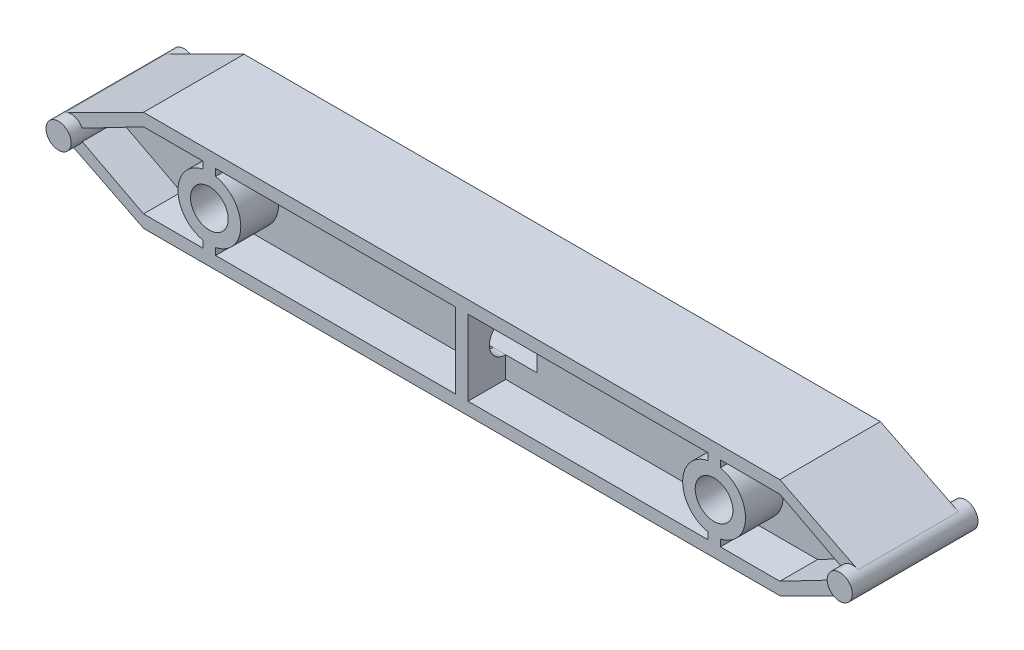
ISO-10303-21;
HEADER;
FILE_DESCRIPTION(('STEP AP214'),'2;1');
FILE_NAME('part.step','',(''),(''),'','','');
FILE_SCHEMA(('AUTOMOTIVE_DESIGN { 1 0 10303 214 1 1 1 1 }'));
ENDSEC;
DATA;
#1=APPLICATION_CONTEXT('core data for automotive mechanical design processes');
#2=APPLICATION_PROTOCOL_DEFINITION('international standard','automotive_design',2000,#1);
#3=PRODUCT_CONTEXT('',#1,'mechanical');
#4=PRODUCT('Part','Part','',(#3));
#5=PRODUCT_RELATED_PRODUCT_CATEGORY('part','',(#4));
#6=PRODUCT_DEFINITION_FORMATION('','',#4);
#7=PRODUCT_DEFINITION_CONTEXT('part definition',#1,'design');
#8=PRODUCT_DEFINITION('design','',#6,#7);
#9=PRODUCT_DEFINITION_SHAPE('','',#8);
#10=(LENGTH_UNIT() NAMED_UNIT(*) SI_UNIT(.MILLI.,.METRE.));
#11=(NAMED_UNIT(*) PLANE_ANGLE_UNIT() SI_UNIT($,.RADIAN.));
#12=(NAMED_UNIT(*) SI_UNIT($,.STERADIAN.) SOLID_ANGLE_UNIT());
#13=UNCERTAINTY_MEASURE_WITH_UNIT(LENGTH_MEASURE(1.E-05),#10,'distance_accuracy_value','');
#14=(GEOMETRIC_REPRESENTATION_CONTEXT(3) GLOBAL_UNCERTAINTY_ASSIGNED_CONTEXT((#13)) GLOBAL_UNIT_ASSIGNED_CONTEXT((#10,
#11,#12)) REPRESENTATION_CONTEXT('',''));
#15=CARTESIAN_POINT('',(0.,0.,0.));
#16=DIRECTION('',(0.,0.,1.));
#17=DIRECTION('',(1.,0.,0.));
#18=AXIS2_PLACEMENT_3D('',#15,#16,#17);
#19=CARTESIAN_POINT('',(0.,0.,3.81));
#20=DIRECTION('',(0.,0.,-1.));
#21=DIRECTION('',(-1.,0.,0.));
#22=AXIS2_PLACEMENT_3D('',#19,#20,#21);
#23=PLANE('',#22);
#24=DIRECTION('',(1.,0.,0.));
#25=VECTOR('',#24,1.);
#26=CARTESIAN_POINT('',(0.,-3.81,3.81));
#27=LINE('',#26,#25);
#28=CARTESIAN_POINT('',(-6.1920507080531,-3.81,3.81));
#29=VERTEX_POINT('',#28);
#30=CARTESIAN_POINT('',(-0.177244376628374,-3.81,3.81));
#31=VERTEX_POINT('',#30);
#32=EDGE_CURVE('E723',#29,#31,#27,.T.);
#33=ORIENTED_EDGE('',*,*,#32,.F.);
#34=DIRECTION('',(0.,-1.,0.));
#35=VECTOR('',#34,1.);
#36=CARTESIAN_POINT('',(-6.1920507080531,0.,3.81));
#37=LINE('',#36,#35);
#38=CARTESIAN_POINT('',(-6.1920507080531,-3.11085197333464,3.81));
#39=VERTEX_POINT('',#38);
#40=EDGE_CURVE('E1246',#39,#29,#37,.T.);
#41=ORIENTED_EDGE('',*,*,#40,.F.);
#42=CARTESIAN_POINT('',(-6.8270507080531,0.,3.81));
#43=DIRECTION('',(0.,0.,-1.));
#44=DIRECTION('',(-1.,0.,0.));
#45=AXIS2_PLACEMENT_3D('',#42,#43,#44);
#46=CIRCLE('',#45,3.175);
#47=CARTESIAN_POINT('',(-6.1920507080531,3.11085197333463,3.81));
#48=VERTEX_POINT('',#47);
#49=EDGE_CURVE('E482',#48,#39,#46,.T.);
#50=ORIENTED_EDGE('',*,*,#49,.F.);
#51=DIRECTION('',(0.,-1.,0.));
#52=VECTOR('',#51,1.);
#53=CARTESIAN_POINT('',(-6.1920507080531,0.,3.81));
#54=LINE('',#53,#52);
#55=CARTESIAN_POINT('',(-6.1920507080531,3.81,3.81));
#56=VERTEX_POINT('',#55);
#57=EDGE_CURVE('E478',#56,#48,#54,.T.);
#58=ORIENTED_EDGE('',*,*,#57,.F.);
#59=DIRECTION('',(-1.,0.,0.));
#60=VECTOR('',#59,1.);
#61=CARTESIAN_POINT('',(0.,3.81,3.81));
#62=LINE('',#61,#60);
#63=CARTESIAN_POINT('',(-0.177244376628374,3.81,3.81));
#64=VERTEX_POINT('',#63);
#65=EDGE_CURVE('E710',#64,#56,#62,.T.);
#66=ORIENTED_EDGE('',*,*,#65,.F.);
#67=DIRECTION('',(0.91412187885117,-0.405439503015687,0.));
#68=VECTOR('',#67,1.);
#69=CARTESIAN_POINT('',(1.38293082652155,3.11801715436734,3.81));
#70=LINE('',#69,#68);
#71=CARTESIAN_POINT('',(6.29047792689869,0.941378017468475,3.81));
#72=VERTEX_POINT('',#71);
#73=EDGE_CURVE('E713',#64,#72,#70,.T.);
#74=ORIENTED_EDGE('',*,*,#73,.T.);
#75=CARTESIAN_POINT('',(7.14294929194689,0.,3.81));
#76=DIRECTION('',(0.,0.,-1.));
#77=DIRECTION('',(-1.,0.,0.));
#78=AXIS2_PLACEMENT_3D('',#75,#76,#77);
#79=CIRCLE('',#78,1.27000000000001);
#80=CARTESIAN_POINT('',(6.29047792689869,-0.941378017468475,3.81));
#81=VERTEX_POINT('',#80);
#82=EDGE_CURVE('E718',#72,#81,#79,.F.);
#83=ORIENTED_EDGE('',*,*,#82,.T.);
#84=DIRECTION('',(0.91412187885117,0.405439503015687,0.));
#85=VECTOR('',#84,1.);
#86=CARTESIAN_POINT('',(1.38293082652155,-3.11801715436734,3.81));
#87=LINE('',#86,#85);
#88=EDGE_CURVE('E721',#31,#81,#87,.T.);
#89=ORIENTED_EDGE('',*,*,#88,.F.);
#90=EDGE_LOOP('',(#33,#41,#50,#58,#66,#74,#83,#89));
#91=FACE_BOUND('',#90,.T.);
#92=ADVANCED_FACE('F44',(#91),#23,.T.);
#93=CARTESIAN_POINT('',(0.,3.81,3.81));
#94=DIRECTION('',(0.,-1.,0.));
#95=DIRECTION('',(0.,0.,-1.));
#96=AXIS2_PLACEMENT_3D('',#93,#94,#95);
#97=PLANE('',#96);
#98=ORIENTED_EDGE('',*,*,#65,.T.);
#99=DIRECTION('',(0.,0.,1.));
#100=VECTOR('',#99,1.);
#101=CARTESIAN_POINT('',(-6.1920507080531,3.81,0.));
#102=LINE('',#101,#100);
#103=CARTESIAN_POINT('',(-6.1920507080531,3.81,0.));
#104=VERTEX_POINT('',#103);
#105=EDGE_CURVE('E1240',#104,#56,#102,.T.);
#106=ORIENTED_EDGE('',*,*,#105,.F.);
#107=DIRECTION('',(-1.,0.,0.));
#108=VECTOR('',#107,1.);
#109=CARTESIAN_POINT('',(0.,3.81,0.));
#110=LINE('',#109,#108);
#111=CARTESIAN_POINT('',(-0.177244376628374,3.81,0.));
#112=VERTEX_POINT('',#111);
#113=EDGE_CURVE('E737',#112,#104,#110,.T.);
#114=ORIENTED_EDGE('',*,*,#113,.F.);
#115=DIRECTION('',(0.,0.,-1.));
#116=VECTOR('',#115,1.);
#117=CARTESIAN_POINT('',(-0.177244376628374,3.81,3.81));
#118=LINE('',#117,#116);
#119=EDGE_CURVE('E736',#64,#112,#118,.T.);
#120=ORIENTED_EDGE('',*,*,#119,.F.);
#121=EDGE_LOOP('',(#98,#106,#114,#120));
#122=FACE_BOUND('',#121,.T.);
#123=ADVANCED_FACE('F1062',(#122),#97,.T.);
#124=CARTESIAN_POINT('',(0.,-3.81,3.81));
#125=DIRECTION('',(0.,1.,0.));
#126=DIRECTION('',(0.,0.,1.));
#127=AXIS2_PLACEMENT_3D('',#124,#125,#126);
#128=PLANE('',#127);
#129=DIRECTION('',(1.,0.,0.));
#130=VECTOR('',#129,1.);
#131=CARTESIAN_POINT('',(0.,-3.81,0.));
#132=LINE('',#131,#130);
#133=CARTESIAN_POINT('',(-6.1920507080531,-3.81,0.));
#134=VERTEX_POINT('',#133);
#135=CARTESIAN_POINT('',(-0.177244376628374,-3.81,0.));
#136=VERTEX_POINT('',#135);
#137=EDGE_CURVE('E746',#134,#136,#132,.T.);
#138=ORIENTED_EDGE('',*,*,#137,.F.);
#139=DIRECTION('',(0.,0.,1.));
#140=VECTOR('',#139,1.);
#141=CARTESIAN_POINT('',(-6.1920507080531,-3.81,0.));
#142=LINE('',#141,#140);
#143=EDGE_CURVE('E463',#134,#29,#142,.T.);
#144=ORIENTED_EDGE('',*,*,#143,.T.);
#145=ORIENTED_EDGE('',*,*,#32,.T.);
#146=DIRECTION('',(0.,0.,-1.));
#147=VECTOR('',#146,1.);
#148=CARTESIAN_POINT('',(-0.177244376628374,-3.81,3.81));
#149=LINE('',#148,#147);
#150=EDGE_CURVE('E767',#31,#136,#149,.T.);
#151=ORIENTED_EDGE('',*,*,#150,.T.);
#152=EDGE_LOOP('',(#138,#144,#145,#151));
#153=FACE_BOUND('',#152,.T.);
#154=ADVANCED_FACE('F1069',(#153),#128,.T.);
#155=DIRECTION('',(0.,-1.,0.));
#156=VECTOR('',#155,1.);
#157=CARTESIAN_POINT('',(-7.4620507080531,0.,3.81));
#158=LINE('',#157,#156);
#159=CARTESIAN_POINT('',(-7.4620507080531,-3.11085197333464,3.81));
#160=VERTEX_POINT('',#159);
#161=CARTESIAN_POINT('',(-7.4620507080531,-3.81,3.81));
#162=VERTEX_POINT('',#161);
#163=EDGE_CURVE('E1248',#160,#162,#158,.T.);
#164=ORIENTED_EDGE('',*,*,#163,.T.);
#165=CARTESIAN_POINT('',(-57.1883737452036,-3.81,3.81));
#166=VERTEX_POINT('',#165);
#167=EDGE_CURVE('E728',#166,#162,#27,.T.);
#168=ORIENTED_EDGE('',*,*,#167,.F.);
#169=DIRECTION('',(0.,-1.,0.));
#170=VECTOR('',#169,1.);
#171=CARTESIAN_POINT('',(-57.1883737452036,0.,3.81));
#172=LINE('',#171,#170);
#173=CARTESIAN_POINT('',(-57.1883737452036,-3.11085197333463,3.81));
#174=VERTEX_POINT('',#173);
#175=EDGE_CURVE('E487',#174,#166,#172,.T.);
#176=ORIENTED_EDGE('',*,*,#175,.F.);
#177=CARTESIAN_POINT('',(-57.8233737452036,0.,3.81));
#178=DIRECTION('',(0.,0.,-1.));
#179=DIRECTION('',(-1.,0.,0.));
#180=AXIS2_PLACEMENT_3D('',#177,#178,#179);
#181=CIRCLE('',#180,3.175);
#182=CARTESIAN_POINT('',(-57.1883737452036,3.11085197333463,3.81));
#183=VERTEX_POINT('',#182);
#184=EDGE_CURVE('E484',#183,#174,#181,.T.);
#185=ORIENTED_EDGE('',*,*,#184,.F.);
#186=DIRECTION('',(0.,-1.,0.));
#187=VECTOR('',#186,1.);
#188=CARTESIAN_POINT('',(-57.1883737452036,0.,3.81));
#189=LINE('',#188,#187);
#190=CARTESIAN_POINT('',(-57.1883737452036,3.81,3.81));
#191=VERTEX_POINT('',#190);
#192=EDGE_CURVE('E497',#191,#183,#189,.T.);
#193=ORIENTED_EDGE('',*,*,#192,.F.);
#194=CARTESIAN_POINT('',(-7.4620507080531,3.81,3.81));
#195=VERTEX_POINT('',#194);
#196=EDGE_CURVE('E714',#195,#191,#62,.T.);
#197=ORIENTED_EDGE('',*,*,#196,.F.);
#198=DIRECTION('',(0.,-1.,0.));
#199=VECTOR('',#198,1.);
#200=CARTESIAN_POINT('',(-7.4620507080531,0.,3.81));
#201=LINE('',#200,#199);
#202=CARTESIAN_POINT('',(-7.4620507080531,3.11085197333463,3.81));
#203=VERTEX_POINT('',#202);
#204=EDGE_CURVE('E1254',#195,#203,#201,.T.);
#205=ORIENTED_EDGE('',*,*,#204,.T.);
#206=CARTESIAN_POINT('',(-6.8270507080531,0.,3.81));
#207=DIRECTION('',(0.,0.,-1.));
#208=DIRECTION('',(-1.,0.,0.));
#209=AXIS2_PLACEMENT_3D('',#206,#207,#208);
#210=CIRCLE('',#209,3.175);
#211=EDGE_CURVE('E1251',#160,#203,#210,.T.);
#212=ORIENTED_EDGE('',*,*,#211,.F.);
#213=EDGE_LOOP('',(#164,#168,#176,#185,#193,#197,#205,#212));
#214=FACE_BOUND('',#213,.T.);
#215=DIRECTION('',(-1.,0.,0.));
#216=VECTOR('',#215,1.);
#217=CARTESIAN_POINT('',(0.,-1.651,3.81));
#218=LINE('',#217,#216);
#219=CARTESIAN_POINT('',(-28.5152122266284,-1.651,3.81));
#220=VERTEX_POINT('',#219);
#221=CARTESIAN_POINT('',(-36.1352122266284,-1.651,3.81));
#222=VERTEX_POINT('',#221);
#223=EDGE_CURVE('E52',#220,#222,#218,.T.);
#224=ORIENTED_EDGE('',*,*,#223,.F.);
#225=DIRECTION('',(0.,1.,0.));
#226=VECTOR('',#225,1.);
#227=CARTESIAN_POINT('',(-28.5152122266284,0.,3.81));
#228=LINE('',#227,#226);
#229=CARTESIAN_POINT('',(-28.5152122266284,1.651,3.81));
#230=VERTEX_POINT('',#229);
#231=EDGE_CURVE('E12',#220,#230,#228,.T.);
#232=ORIENTED_EDGE('',*,*,#231,.T.);
#233=DIRECTION('',(-1.,0.,0.));
#234=VECTOR('',#233,1.);
#235=CARTESIAN_POINT('',(0.,1.651,3.81));
#236=LINE('',#235,#234);
#237=CARTESIAN_POINT('',(-36.1352122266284,1.651,3.81));
#238=VERTEX_POINT('',#237);
#239=EDGE_CURVE('E848',#230,#238,#236,.T.);
#240=ORIENTED_EDGE('',*,*,#239,.T.);
#241=DIRECTION('',(0.,1.,0.));
#242=VECTOR('',#241,1.);
#243=CARTESIAN_POINT('',(-36.1352122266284,0.,3.81));
#244=LINE('',#243,#242);
#245=EDGE_CURVE('E851',#222,#238,#244,.T.);
#246=ORIENTED_EDGE('',*,*,#245,.F.);
#247=EDGE_LOOP('',(#224,#232,#240,#246));
#248=FACE_BOUND('',#247,.T.);
#249=ADVANCED_FACE('F864',(#214,#248),#23,.T.);
#250=DIRECTION('',(0.,0.,1.));
#251=VECTOR('',#250,1.);
#252=CARTESIAN_POINT('',(-7.4620507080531,3.81,0.));
#253=LINE('',#252,#251);
#254=CARTESIAN_POINT('',(-7.4620507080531,3.81,0.));
#255=VERTEX_POINT('',#254);
#256=EDGE_CURVE('E1126',#255,#195,#253,.T.);
#257=ORIENTED_EDGE('',*,*,#256,.T.);
#258=ORIENTED_EDGE('',*,*,#196,.T.);
#259=DIRECTION('',(0.,0.,1.));
#260=VECTOR('',#259,1.);
#261=CARTESIAN_POINT('',(-57.1883737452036,3.81,0.));
#262=LINE('',#261,#260);
#263=CARTESIAN_POINT('',(-57.1883737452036,3.81,0.));
#264=VERTEX_POINT('',#263);
#265=EDGE_CURVE('E525',#264,#191,#262,.T.);
#266=ORIENTED_EDGE('',*,*,#265,.F.);
#267=EDGE_CURVE('E740',#255,#264,#110,.T.);
#268=ORIENTED_EDGE('',*,*,#267,.F.);
#269=EDGE_LOOP('',(#257,#258,#266,#268));
#270=FACE_BOUND('',#269,.T.);
#271=ADVANCED_FACE('F1072',(#270),#97,.T.);
#272=DIRECTION('',(0.,0.,1.));
#273=VECTOR('',#272,1.);
#274=CARTESIAN_POINT('',(-7.4620507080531,-3.81,0.));
#275=LINE('',#274,#273);
#276=CARTESIAN_POINT('',(-7.4620507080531,-3.81,0.));
#277=VERTEX_POINT('',#276);
#278=EDGE_CURVE('E489',#277,#162,#275,.T.);
#279=ORIENTED_EDGE('',*,*,#278,.F.);
#280=CARTESIAN_POINT('',(-57.1883737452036,-3.81,0.));
#281=VERTEX_POINT('',#280);
#282=EDGE_CURVE('E751',#281,#277,#132,.T.);
#283=ORIENTED_EDGE('',*,*,#282,.F.);
#284=DIRECTION('',(0.,0.,1.));
#285=VECTOR('',#284,1.);
#286=CARTESIAN_POINT('',(-57.1883737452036,-3.81,0.));
#287=LINE('',#286,#285);
#288=EDGE_CURVE('E67',#281,#166,#287,.T.);
#289=ORIENTED_EDGE('',*,*,#288,.T.);
#290=ORIENTED_EDGE('',*,*,#167,.T.);
#291=EDGE_LOOP('',(#279,#283,#289,#290));
#292=FACE_BOUND('',#291,.T.);
#293=ADVANCED_FACE('F1273',(#292),#128,.T.);
#294=CARTESIAN_POINT('',(0.,0.,6.35));
#295=DIRECTION('',(0.,0.,1.));
#296=DIRECTION('',(1.,0.,0.));
#297=AXIS2_PLACEMENT_3D('',#294,#295,#296);
#298=PLANE('',#297);
#299=DIRECTION('',(1.,0.,0.));
#300=VECTOR('',#299,1.);
#301=CARTESIAN_POINT('',(0.,-3.81,6.35));
#302=LINE('',#301,#300);
#303=CARTESIAN_POINT('',(-57.1883737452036,-3.81,6.35));
#304=VERTEX_POINT('',#303);
#305=CARTESIAN_POINT('',(-32.9602122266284,-3.81,6.35));
#306=VERTEX_POINT('',#305);
#307=EDGE_CURVE('E896',#304,#306,#302,.T.);
#308=ORIENTED_EDGE('',*,*,#307,.T.);
#309=DIRECTION('',(0.,-1.,0.));
#310=VECTOR('',#309,1.);
#311=CARTESIAN_POINT('',(-32.9602122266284,0.,6.35));
#312=LINE('',#311,#310);
#313=CARTESIAN_POINT('',(-32.9602122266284,-1.651,6.35));
#314=VERTEX_POINT('',#313);
#315=EDGE_CURVE('E554',#314,#306,#312,.T.);
#316=ORIENTED_EDGE('',*,*,#315,.F.);
#317=DIRECTION('',(1.,0.,0.));
#318=VECTOR('',#317,1.);
#319=CARTESIAN_POINT('',(0.,-1.651,6.35));
#320=LINE('',#319,#318);
#321=CARTESIAN_POINT('',(-36.1352122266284,-1.651,6.35));
#322=VERTEX_POINT('',#321);
#323=EDGE_CURVE('E695',#322,#314,#320,.T.);
#324=ORIENTED_EDGE('',*,*,#323,.F.);
#325=DIRECTION('',(0.,-1.,0.));
#326=VECTOR('',#325,1.);
#327=CARTESIAN_POINT('',(-36.1352122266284,0.,6.35));
#328=LINE('',#327,#326);
#329=CARTESIAN_POINT('',(-36.1352122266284,1.651,6.35));
#330=VERTEX_POINT('',#329);
#331=EDGE_CURVE('E698',#330,#322,#328,.T.);
#332=ORIENTED_EDGE('',*,*,#331,.F.);
#333=DIRECTION('',(1.,0.,0.));
#334=VECTOR('',#333,1.);
#335=CARTESIAN_POINT('',(0.,1.651,6.35));
#336=LINE('',#335,#334);
#337=CARTESIAN_POINT('',(-32.9602122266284,1.65100000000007,6.35));
#338=VERTEX_POINT('',#337);
#339=EDGE_CURVE('E702',#330,#338,#336,.T.);
#340=ORIENTED_EDGE('',*,*,#339,.T.);
#341=CARTESIAN_POINT('',(-32.9602122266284,3.81,6.35));
#342=VERTEX_POINT('',#341);
#343=EDGE_CURVE('E548',#342,#338,#312,.T.);
#344=ORIENTED_EDGE('',*,*,#343,.F.);
#345=DIRECTION('',(-1.,0.,0.));
#346=VECTOR('',#345,1.);
#347=CARTESIAN_POINT('',(0.,3.81,6.35));
#348=LINE('',#347,#346);
#349=CARTESIAN_POINT('',(-57.1883737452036,3.81,6.35));
#350=VERTEX_POINT('',#349);
#351=EDGE_CURVE('E1047',#342,#350,#348,.T.);
#352=ORIENTED_EDGE('',*,*,#351,.T.);
#353=DIRECTION('',(0.,-1.,0.));
#354=VECTOR('',#353,1.);
#355=CARTESIAN_POINT('',(-57.1883737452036,0.,6.35));
#356=LINE('',#355,#354);
#357=CARTESIAN_POINT('',(-57.1883737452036,3.11085197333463,6.35));
#358=VERTEX_POINT('',#357);
#359=EDGE_CURVE('E600',#350,#358,#356,.T.);
#360=ORIENTED_EDGE('',*,*,#359,.T.);
#361=CARTESIAN_POINT('',(-57.8233737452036,0.,6.35));
#362=DIRECTION('',(0.,0.,1.));
#363=DIRECTION('',(1.,0.,0.));
#364=AXIS2_PLACEMENT_3D('',#361,#362,#363);
#365=CIRCLE('',#364,3.175);
#366=CARTESIAN_POINT('',(-57.1883737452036,-3.11085197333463,6.35));
#367=VERTEX_POINT('',#366);
#368=EDGE_CURVE('E597',#367,#358,#365,.T.);
#369=ORIENTED_EDGE('',*,*,#368,.F.);
#370=DIRECTION('',(0.,-1.,0.));
#371=VECTOR('',#370,1.);
#372=CARTESIAN_POINT('',(-57.1883737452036,0.,6.35));
#373=LINE('',#372,#371);
#374=EDGE_CURVE('E595',#367,#304,#373,.T.);
#375=ORIENTED_EDGE('',*,*,#374,.T.);
#376=EDGE_LOOP('',(#308,#316,#324,#332,#340,#344,#352,#360,#369,#375));
#377=FACE_BOUND('',#376,.T.);
#378=ADVANCED_FACE('F1090',(#377),#298,.T.);
#379=CARTESIAN_POINT('',(0.,-3.81,6.35));
#380=DIRECTION('',(0.,-1.,0.));
#381=DIRECTION('',(0.,0.,-1.));
#382=AXIS2_PLACEMENT_3D('',#379,#380,#381);
#383=PLANE('',#382);
#384=DIRECTION('',(0.,0.,-1.));
#385=VECTOR('',#384,1.);
#386=CARTESIAN_POINT('',(-32.9602122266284,-3.81,10.16));
#387=LINE('',#386,#385);
#388=CARTESIAN_POINT('',(-32.9602122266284,-3.81,10.16));
#389=VERTEX_POINT('',#388);
#390=EDGE_CURVE('E558',#389,#306,#387,.T.);
#391=ORIENTED_EDGE('',*,*,#390,.T.);
#392=ORIENTED_EDGE('',*,*,#307,.F.);
#393=DIRECTION('',(0.,0.,-1.));
#394=VECTOR('',#393,1.);
#395=CARTESIAN_POINT('',(-57.1883737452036,-3.81,10.16));
#396=LINE('',#395,#394);
#397=CARTESIAN_POINT('',(-57.1883737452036,-3.81,10.16));
#398=VERTEX_POINT('',#397);
#399=EDGE_CURVE('E618',#398,#304,#396,.T.);
#400=ORIENTED_EDGE('',*,*,#399,.F.);
#401=DIRECTION('',(1.,0.,0.));
#402=VECTOR('',#401,1.);
#403=CARTESIAN_POINT('',(0.,-3.81,10.16));
#404=LINE('',#403,#402);
#405=EDGE_CURVE('E927',#398,#389,#404,.T.);
#406=ORIENTED_EDGE('',*,*,#405,.T.);
#407=EDGE_LOOP('',(#391,#392,#400,#406));
#408=FACE_BOUND('',#407,.T.);
#409=ADVANCED_FACE('F1468',(#408),#383,.F.);
#410=CARTESIAN_POINT('',(0.,3.81,6.35));
#411=DIRECTION('',(0.,1.,0.));
#412=DIRECTION('',(0.,0.,1.));
#413=AXIS2_PLACEMENT_3D('',#410,#411,#412);
#414=PLANE('',#413);
#415=DIRECTION('',(0.,0.,-1.));
#416=VECTOR('',#415,1.);
#417=CARTESIAN_POINT('',(-32.9602122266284,3.81,10.16));
#418=LINE('',#417,#416);
#419=CARTESIAN_POINT('',(-32.9602122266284,3.81,10.16));
#420=VERTEX_POINT('',#419);
#421=EDGE_CURVE('E561',#420,#342,#418,.T.);
#422=ORIENTED_EDGE('',*,*,#421,.F.);
#423=DIRECTION('',(-1.,0.,0.));
#424=VECTOR('',#423,1.);
#425=CARTESIAN_POINT('',(0.,3.81,10.16));
#426=LINE('',#425,#424);
#427=CARTESIAN_POINT('',(-57.1883737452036,3.81,10.16));
#428=VERTEX_POINT('',#427);
#429=EDGE_CURVE('E923',#420,#428,#426,.T.);
#430=ORIENTED_EDGE('',*,*,#429,.T.);
#431=DIRECTION('',(0.,0.,-1.));
#432=VECTOR('',#431,1.);
#433=CARTESIAN_POINT('',(-57.1883737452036,3.81,10.16));
#434=LINE('',#433,#432);
#435=EDGE_CURVE('E609',#428,#350,#434,.T.);
#436=ORIENTED_EDGE('',*,*,#435,.T.);
#437=ORIENTED_EDGE('',*,*,#351,.F.);
#438=EDGE_LOOP('',(#422,#430,#436,#437));
#439=FACE_BOUND('',#438,.T.);
#440=ADVANCED_FACE('F1473',(#439),#414,.F.);
#441=CARTESIAN_POINT('',(-64.4731800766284,-3.81,6.35));
#442=VERTEX_POINT('',#441);
#443=CARTESIAN_POINT('',(-58.4583737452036,-3.81,6.35));
#444=VERTEX_POINT('',#443);
#445=EDGE_CURVE('E899',#442,#444,#302,.T.);
#446=ORIENTED_EDGE('',*,*,#445,.T.);
#447=DIRECTION('',(0.,-1.,0.));
#448=VECTOR('',#447,1.);
#449=CARTESIAN_POINT('',(-58.4583737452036,0.,6.35));
#450=LINE('',#449,#448);
#451=CARTESIAN_POINT('',(-58.4583737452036,-3.11085197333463,6.35));
#452=VERTEX_POINT('',#451);
#453=EDGE_CURVE('E592',#452,#444,#450,.T.);
#454=ORIENTED_EDGE('',*,*,#453,.F.);
#455=CARTESIAN_POINT('',(-57.8233737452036,0.,6.35));
#456=DIRECTION('',(0.,0.,1.));
#457=DIRECTION('',(1.,0.,0.));
#458=AXIS2_PLACEMENT_3D('',#455,#456,#457);
#459=CIRCLE('',#458,3.175);
#460=CARTESIAN_POINT('',(-58.4583737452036,3.11085197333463,6.35));
#461=VERTEX_POINT('',#460);
#462=EDGE_CURVE('E568',#461,#452,#459,.T.);
#463=ORIENTED_EDGE('',*,*,#462,.F.);
#464=DIRECTION('',(0.,-1.,0.));
#465=VECTOR('',#464,1.);
#466=CARTESIAN_POINT('',(-58.4583737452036,0.,6.35));
#467=LINE('',#466,#465);
#468=CARTESIAN_POINT('',(-58.4583737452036,3.81,6.35));
#469=VERTEX_POINT('',#468);
#470=EDGE_CURVE('E573',#469,#461,#467,.T.);
#471=ORIENTED_EDGE('',*,*,#470,.F.);
#472=CARTESIAN_POINT('',(-64.4731800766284,3.81,6.35));
#473=VERTEX_POINT('',#472);
#474=EDGE_CURVE('E1039',#469,#473,#348,.T.);
#475=ORIENTED_EDGE('',*,*,#474,.T.);
#476=DIRECTION('',(-0.887043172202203,-0.461686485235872,0.));
#477=VECTOR('',#476,1.);
#478=CARTESIAN_POINT('',(-15.3030742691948,29.4019599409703,6.35));
#479=LINE('',#478,#477);
#480=CARTESIAN_POINT('',(-70.6668289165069,0.58634183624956,6.35));
#481=VERTEX_POINT('',#480);
#482=EDGE_CURVE('E1036',#473,#481,#479,.T.);
#483=ORIENTED_EDGE('',*,*,#482,.T.);
#484=CARTESIAN_POINT('',(-71.7933737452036,0.,6.35));
#485=DIRECTION('',(0.,0.,1.));
#486=DIRECTION('',(1.,0.,0.));
#487=AXIS2_PLACEMENT_3D('',#484,#485,#486);
#488=CIRCLE('',#487,1.26999999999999);
#489=CARTESIAN_POINT('',(-70.6668289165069,-0.586341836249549,6.35));
#490=VERTEX_POINT('',#489);
#491=EDGE_CURVE('E1030',#490,#481,#488,.T.);
#492=ORIENTED_EDGE('',*,*,#491,.F.);
#493=DIRECTION('',(-0.887043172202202,0.461686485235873,0.));
#494=VECTOR('',#493,1.);
#495=CARTESIAN_POINT('',(-15.3030742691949,-29.4019599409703,6.35));
#496=LINE('',#495,#494);
#497=EDGE_CURVE('E901',#442,#490,#496,.T.);
#498=ORIENTED_EDGE('',*,*,#497,.F.);
#499=EDGE_LOOP('',(#446,#454,#463,#471,#475,#483,#492,#498));
#500=FACE_BOUND('',#499,.T.);
#501=ADVANCED_FACE('F1037',(#500),#298,.T.);
#502=DIRECTION('',(0.,0.,-1.));
#503=VECTOR('',#502,1.);
#504=CARTESIAN_POINT('',(-58.4583737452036,-3.81,10.16));
#505=LINE('',#504,#503);
#506=CARTESIAN_POINT('',(-58.4583737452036,-3.81,10.16));
#507=VERTEX_POINT('',#506);
#508=EDGE_CURVE('E621',#507,#444,#505,.T.);
#509=ORIENTED_EDGE('',*,*,#508,.T.);
#510=ORIENTED_EDGE('',*,*,#445,.F.);
#511=DIRECTION('',(0.,0.,1.));
#512=VECTOR('',#511,1.);
#513=CARTESIAN_POINT('',(-64.4731800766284,-3.81,6.35));
#514=LINE('',#513,#512);
#515=CARTESIAN_POINT('',(-64.4731800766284,-3.81,10.16));
#516=VERTEX_POINT('',#515);
#517=EDGE_CURVE('E824',#442,#516,#514,.T.);
#518=ORIENTED_EDGE('',*,*,#517,.T.);
#519=EDGE_CURVE('E924',#516,#507,#404,.T.);
#520=ORIENTED_EDGE('',*,*,#519,.T.);
#521=EDGE_LOOP('',(#509,#510,#518,#520));
#522=FACE_BOUND('',#521,.T.);
#523=ADVANCED_FACE('F1476',(#522),#383,.F.);
#524=DIRECTION('',(0.,0.,-1.));
#525=VECTOR('',#524,1.);
#526=CARTESIAN_POINT('',(-58.4583737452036,3.81,10.16));
#527=LINE('',#526,#525);
#528=CARTESIAN_POINT('',(-58.4583737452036,3.81,10.16));
#529=VERTEX_POINT('',#528);
#530=EDGE_CURVE('E606',#529,#469,#527,.T.);
#531=ORIENTED_EDGE('',*,*,#530,.F.);
#532=CARTESIAN_POINT('',(-64.4731800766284,3.81,10.16));
#533=VERTEX_POINT('',#532);
#534=EDGE_CURVE('E919',#529,#533,#426,.T.);
#535=ORIENTED_EDGE('',*,*,#534,.T.);
#536=DIRECTION('',(0.,0.,1.));
#537=VECTOR('',#536,1.);
#538=CARTESIAN_POINT('',(-64.4731800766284,3.81,6.35));
#539=LINE('',#538,#537);
#540=EDGE_CURVE('E938',#473,#533,#539,.T.);
#541=ORIENTED_EDGE('',*,*,#540,.F.);
#542=ORIENTED_EDGE('',*,*,#474,.F.);
#543=EDGE_LOOP('',(#531,#535,#541,#542));
#544=FACE_BOUND('',#543,.T.);
#545=ADVANCED_FACE('F1489',(#544),#414,.F.);
#546=DIRECTION('',(0.,-1.,0.));
#547=VECTOR('',#546,1.);
#548=CARTESIAN_POINT('',(-31.6902122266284,0.,6.35));
#549=LINE('',#548,#547);
#550=CARTESIAN_POINT('',(-31.6902122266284,-1.65099999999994,6.35));
#551=VERTEX_POINT('',#550);
#552=CARTESIAN_POINT('',(-31.6902122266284,-3.81,6.35));
#553=VERTEX_POINT('',#552);
#554=EDGE_CURVE('E544',#551,#553,#549,.T.);
#555=ORIENTED_EDGE('',*,*,#554,.T.);
#556=CARTESIAN_POINT('',(-7.4620507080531,-3.81,6.35));
#557=VERTEX_POINT('',#556);
#558=EDGE_CURVE('E891',#553,#557,#302,.T.);
#559=ORIENTED_EDGE('',*,*,#558,.T.);
#560=DIRECTION('',(0.,-1.,0.));
#561=VECTOR('',#560,1.);
#562=CARTESIAN_POINT('',(-7.4620507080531,0.,6.35));
#563=LINE('',#562,#561);
#564=CARTESIAN_POINT('',(-7.4620507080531,-3.11085197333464,6.35));
#565=VERTEX_POINT('',#564);
#566=EDGE_CURVE('E650',#565,#557,#563,.T.);
#567=ORIENTED_EDGE('',*,*,#566,.F.);
#568=CARTESIAN_POINT('',(-6.8270507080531,0.,6.35));
#569=DIRECTION('',(0.,0.,1.));
#570=DIRECTION('',(1.,0.,0.));
#571=AXIS2_PLACEMENT_3D('',#568,#569,#570);
#572=CIRCLE('',#571,3.175);
#573=CARTESIAN_POINT('',(-7.4620507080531,3.11085197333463,6.35));
#574=VERTEX_POINT('',#573);
#575=EDGE_CURVE('E626',#574,#565,#572,.T.);
#576=ORIENTED_EDGE('',*,*,#575,.F.);
#577=DIRECTION('',(0.,-1.,0.));
#578=VECTOR('',#577,1.);
#579=CARTESIAN_POINT('',(-7.4620507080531,0.,6.35));
#580=LINE('',#579,#578);
#581=CARTESIAN_POINT('',(-7.4620507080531,3.81,6.35));
#582=VERTEX_POINT('',#581);
#583=EDGE_CURVE('E631',#582,#574,#580,.T.);
#584=ORIENTED_EDGE('',*,*,#583,.F.);
#585=CARTESIAN_POINT('',(-31.6902122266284,3.81,6.35));
#586=VERTEX_POINT('',#585);
#587=EDGE_CURVE('E1045',#582,#586,#348,.T.);
#588=ORIENTED_EDGE('',*,*,#587,.T.);
#589=CARTESIAN_POINT('',(-31.6902122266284,1.65100000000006,6.35));
#590=VERTEX_POINT('',#589);
#591=EDGE_CURVE('E551',#586,#590,#549,.T.);
#592=ORIENTED_EDGE('',*,*,#591,.T.);
#593=CARTESIAN_POINT('',(-28.5152122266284,1.651,6.35));
#594=VERTEX_POINT('',#593);
#595=EDGE_CURVE('E701',#590,#594,#336,.T.);
#596=ORIENTED_EDGE('',*,*,#595,.T.);
#597=DIRECTION('',(0.,-1.,0.));
#598=VECTOR('',#597,1.);
#599=CARTESIAN_POINT('',(-28.5152122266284,0.,6.35));
#600=LINE('',#599,#598);
#601=CARTESIAN_POINT('',(-28.5152122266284,-1.651,6.35));
#602=VERTEX_POINT('',#601);
#603=EDGE_CURVE('E705',#594,#602,#600,.T.);
#604=ORIENTED_EDGE('',*,*,#603,.T.);
#605=EDGE_CURVE('E688',#551,#602,#320,.T.);
#606=ORIENTED_EDGE('',*,*,#605,.F.);
#607=EDGE_LOOP('',(#555,#559,#567,#576,#584,#588,#592,#596,#604,#606));
#608=FACE_BOUND('',#607,.T.);
#609=ADVANCED_FACE('F876',(#608),#298,.T.);
#610=ORIENTED_EDGE('',*,*,#558,.F.);
#611=DIRECTION('',(0.,0.,-1.));
#612=VECTOR('',#611,1.);
#613=CARTESIAN_POINT('',(-31.6902122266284,-3.81,10.16));
#614=LINE('',#613,#612);
#615=CARTESIAN_POINT('',(-31.6902122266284,-3.81,10.16));
#616=VERTEX_POINT('',#615);
#617=EDGE_CURVE('E550',#616,#553,#614,.T.);
#618=ORIENTED_EDGE('',*,*,#617,.F.);
#619=CARTESIAN_POINT('',(-7.4620507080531,-3.81,10.16));
#620=VERTEX_POINT('',#619);
#621=EDGE_CURVE('E928',#616,#620,#404,.T.);
#622=ORIENTED_EDGE('',*,*,#621,.T.);
#623=DIRECTION('',(0.,0.,-1.));
#624=VECTOR('',#623,1.);
#625=CARTESIAN_POINT('',(-7.4620507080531,-3.81,10.16));
#626=LINE('',#625,#624);
#627=EDGE_CURVE('E678',#620,#557,#626,.T.);
#628=ORIENTED_EDGE('',*,*,#627,.T.);
#629=EDGE_LOOP('',(#610,#618,#622,#628));
#630=FACE_BOUND('',#629,.T.);
#631=ADVANCED_FACE('F893',(#630),#383,.F.);
#632=CARTESIAN_POINT('',(-7.4620507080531,3.81,10.16));
#633=VERTEX_POINT('',#632);
#634=CARTESIAN_POINT('',(-31.6902122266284,3.81,10.16));
#635=VERTEX_POINT('',#634);
#636=EDGE_CURVE('E922',#633,#635,#426,.T.);
#637=ORIENTED_EDGE('',*,*,#636,.T.);
#638=DIRECTION('',(0.,0.,-1.));
#639=VECTOR('',#638,1.);
#640=CARTESIAN_POINT('',(-31.6902122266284,3.81,10.16));
#641=LINE('',#640,#639);
#642=EDGE_CURVE('E564',#635,#586,#641,.T.);
#643=ORIENTED_EDGE('',*,*,#642,.T.);
#644=ORIENTED_EDGE('',*,*,#587,.F.);
#645=DIRECTION('',(0.,0.,-1.));
#646=VECTOR('',#645,1.);
#647=CARTESIAN_POINT('',(-7.4620507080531,3.81,10.16));
#648=LINE('',#647,#646);
#649=EDGE_CURVE('E664',#633,#582,#648,.T.);
#650=ORIENTED_EDGE('',*,*,#649,.F.);
#651=EDGE_LOOP('',(#637,#643,#644,#650));
#652=FACE_BOUND('',#651,.T.);
#653=ADVANCED_FACE('F1088',(#652),#414,.F.);
#654=DIRECTION('',(0.,-1.,0.));
#655=VECTOR('',#654,1.);
#656=CARTESIAN_POINT('',(-6.1920507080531,0.,6.35));
#657=LINE('',#656,#655);
#658=CARTESIAN_POINT('',(-6.1920507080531,-3.11085197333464,6.35));
#659=VERTEX_POINT('',#658);
#660=CARTESIAN_POINT('',(-6.1920507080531,-3.81,6.35));
#661=VERTEX_POINT('',#660);
#662=EDGE_CURVE('E653',#659,#661,#657,.T.);
#663=ORIENTED_EDGE('',*,*,#662,.T.);
#664=CARTESIAN_POINT('',(-0.177244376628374,-3.81,6.35));
#665=VERTEX_POINT('',#664);
#666=EDGE_CURVE('E897',#661,#665,#302,.T.);
#667=ORIENTED_EDGE('',*,*,#666,.T.);
#668=DIRECTION('',(0.887043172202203,0.461686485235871,0.));
#669=VECTOR('',#668,1.);
#670=CARTESIAN_POINT('',(1.52255114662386,-2.92529376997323,6.35));
#671=LINE('',#670,#669);
#672=CARTESIAN_POINT('',(6.01640446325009,-0.586341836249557,6.35));
#673=VERTEX_POINT('',#672);
#674=EDGE_CURVE('E905',#665,#673,#671,.T.);
#675=ORIENTED_EDGE('',*,*,#674,.T.);
#676=CARTESIAN_POINT('',(7.14294929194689,0.,6.35));
#677=DIRECTION('',(0.,0.,1.));
#678=DIRECTION('',(1.,0.,0.));
#679=AXIS2_PLACEMENT_3D('',#676,#677,#678);
#680=CIRCLE('',#679,1.27000000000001);
#681=CARTESIAN_POINT('',(6.01640446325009,0.586341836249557,6.35));
#682=VERTEX_POINT('',#681);
#683=EDGE_CURVE('E804',#682,#673,#680,.T.);
#684=ORIENTED_EDGE('',*,*,#683,.F.);
#685=DIRECTION('',(0.887043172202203,-0.461686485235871,0.));
#686=VECTOR('',#685,1.);
#687=CARTESIAN_POINT('',(1.52255114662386,2.92529376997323,6.35));
#688=LINE('',#687,#686);
#689=CARTESIAN_POINT('',(-0.177244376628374,3.81,6.35));
#690=VERTEX_POINT('',#689);
#691=EDGE_CURVE('E1984',#690,#682,#688,.T.);
#692=ORIENTED_EDGE('',*,*,#691,.F.);
#693=CARTESIAN_POINT('',(-6.1920507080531,3.81,6.35));
#694=VERTEX_POINT('',#693);
#695=EDGE_CURVE('E1041',#690,#694,#348,.T.);
#696=ORIENTED_EDGE('',*,*,#695,.T.);
#697=DIRECTION('',(0.,-1.,0.));
#698=VECTOR('',#697,1.);
#699=CARTESIAN_POINT('',(-6.1920507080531,0.,6.35));
#700=LINE('',#699,#698);
#701=CARTESIAN_POINT('',(-6.1920507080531,3.11085197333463,6.35));
#702=VERTEX_POINT('',#701);
#703=EDGE_CURVE('E658',#694,#702,#700,.T.);
#704=ORIENTED_EDGE('',*,*,#703,.T.);
#705=CARTESIAN_POINT('',(-6.8270507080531,0.,6.35));
#706=DIRECTION('',(0.,0.,1.));
#707=DIRECTION('',(1.,0.,0.));
#708=AXIS2_PLACEMENT_3D('',#705,#706,#707);
#709=CIRCLE('',#708,3.175);
#710=EDGE_CURVE('E655',#659,#702,#709,.T.);
#711=ORIENTED_EDGE('',*,*,#710,.F.);
#712=EDGE_LOOP('',(#663,#667,#675,#684,#692,#696,#704,#711));
#713=FACE_BOUND('',#712,.T.);
#714=ADVANCED_FACE('F1081',(#713),#298,.T.);
#715=DIRECTION('',(0.,-1.,0.));
#716=VECTOR('',#715,1.);
#717=CARTESIAN_POINT('',(-58.4583737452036,0.,3.81));
#718=LINE('',#717,#716);
#719=CARTESIAN_POINT('',(-58.4583737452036,-3.11085197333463,3.81));
#720=VERTEX_POINT('',#719);
#721=CARTESIAN_POINT('',(-58.4583737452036,-3.81,3.81));
#722=VERTEX_POINT('',#721);
#723=EDGE_CURVE('E513',#720,#722,#718,.T.);
#724=ORIENTED_EDGE('',*,*,#723,.T.);
#725=CARTESIAN_POINT('',(-64.4731800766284,-3.81,3.81));
#726=VERTEX_POINT('',#725);
#727=EDGE_CURVE('E724',#726,#722,#27,.T.);
#728=ORIENTED_EDGE('',*,*,#727,.F.);
#729=DIRECTION('',(-0.887043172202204,0.461686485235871,0.));
#730=VECTOR('',#729,1.);
#731=CARTESIAN_POINT('',(-15.3030742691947,-29.4019599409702,3.81));
#732=LINE('',#731,#730);
#733=CARTESIAN_POINT('',(-70.6668289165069,-0.586341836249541,3.81));
#734=VERTEX_POINT('',#733);
#735=EDGE_CURVE('E727',#726,#734,#732,.T.);
#736=ORIENTED_EDGE('',*,*,#735,.T.);
#737=CARTESIAN_POINT('',(-71.7933737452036,0.,3.81));
#738=DIRECTION('',(0.,0.,-1.));
#739=DIRECTION('',(-1.,0.,0.));
#740=AXIS2_PLACEMENT_3D('',#737,#738,#739);
#741=CIRCLE('',#740,1.26999999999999);
#742=CARTESIAN_POINT('',(-70.6668289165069,0.586341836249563,3.81));
#743=VERTEX_POINT('',#742);
#744=EDGE_CURVE('E731',#734,#743,#741,.F.);
#745=ORIENTED_EDGE('',*,*,#744,.T.);
#746=DIRECTION('',(-0.887043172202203,-0.461686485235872,0.));
#747=VECTOR('',#746,1.);
#748=CARTESIAN_POINT('',(-15.3030742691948,29.4019599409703,3.81));
#749=LINE('',#748,#747);
#750=CARTESIAN_POINT('',(-64.4731800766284,3.81,3.81));
#751=VERTEX_POINT('',#750);
#752=EDGE_CURVE('E734',#751,#743,#749,.T.);
#753=ORIENTED_EDGE('',*,*,#752,.F.);
#754=CARTESIAN_POINT('',(-58.4583737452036,3.81,3.81));
#755=VERTEX_POINT('',#754);
#756=EDGE_CURVE('E715',#755,#751,#62,.T.);
#757=ORIENTED_EDGE('',*,*,#756,.F.);
#758=DIRECTION('',(0.,-1.,0.));
#759=VECTOR('',#758,1.);
#760=CARTESIAN_POINT('',(-58.4583737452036,0.,3.81));
#761=LINE('',#760,#759);
#762=CARTESIAN_POINT('',(-58.4583737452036,3.11085197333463,3.81));
#763=VERTEX_POINT('',#762);
#764=EDGE_CURVE('E519',#755,#763,#761,.T.);
#765=ORIENTED_EDGE('',*,*,#764,.T.);
#766=CARTESIAN_POINT('',(-57.8233737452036,0.,3.81));
#767=DIRECTION('',(0.,0.,-1.));
#768=DIRECTION('',(-1.,0.,0.));
#769=AXIS2_PLACEMENT_3D('',#766,#767,#768);
#770=CIRCLE('',#769,3.175);
#771=EDGE_CURVE('E516',#720,#763,#770,.T.);
#772=ORIENTED_EDGE('',*,*,#771,.F.);
#773=EDGE_LOOP('',(#724,#728,#736,#745,#753,#757,#765,#772));
#774=FACE_BOUND('',#773,.T.);
#775=ADVANCED_FACE('F1065',(#774),#23,.T.);
#776=CARTESIAN_POINT('',(1.99655112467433,-3.99310224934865,10.16));
#777=DIRECTION('',(-0.447213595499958,0.894427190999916,0.));
#778=DIRECTION('',(-0.894427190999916,-0.447213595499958,0.));
#779=AXIS2_PLACEMENT_3D('',#776,#777,#778);
#780=PLANE('',#779);
#781=DIRECTION('',(0.,0.,1.));
#782=VECTOR('',#781,1.);
#783=CARTESIAN_POINT('',(7.71091055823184,-1.13592253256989,0.));
#784=LINE('',#783,#782);
#785=CARTESIAN_POINT('',(7.71091055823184,-1.13592253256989,0.));
#786=VERTEX_POINT('',#785);
#787=CARTESIAN_POINT('',(7.71091055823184,-1.13592253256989,10.16));
#788=VERTEX_POINT('',#787);
#789=EDGE_CURVE('E991',#786,#788,#784,.T.);
#790=ORIENTED_EDGE('',*,*,#789,.T.);
#791=DIRECTION('',(0.894427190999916,0.447213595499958,0.));
#792=VECTOR('',#791,1.);
#793=CARTESIAN_POINT('',(1.99655112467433,-3.99310224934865,10.16));
#794=LINE('',#793,#792);
#795=CARTESIAN_POINT('',(-0.177244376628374,-5.08,10.16));
#796=VERTEX_POINT('',#795);
#797=EDGE_CURVE('E949',#796,#788,#794,.T.);
#798=ORIENTED_EDGE('',*,*,#797,.F.);
#799=DIRECTION('',(0.,0.,-1.));
#800=VECTOR('',#799,1.);
#801=CARTESIAN_POINT('',(-0.177244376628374,-5.08,10.16));
#802=LINE('',#801,#800);
#803=CARTESIAN_POINT('',(-0.177244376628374,-5.08,0.));
#804=VERTEX_POINT('',#803);
#805=EDGE_CURVE('E970',#796,#804,#802,.T.);
#806=ORIENTED_EDGE('',*,*,#805,.T.);
#807=DIRECTION('',(0.894427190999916,0.447213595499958,0.));
#808=VECTOR('',#807,1.);
#809=CARTESIAN_POINT('',(1.99655112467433,-3.99310224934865,0.));
#810=LINE('',#809,#808);
#811=EDGE_CURVE('E964',#804,#786,#810,.T.);
#812=ORIENTED_EDGE('',*,*,#811,.T.);
#813=EDGE_LOOP('',(#790,#798,#806,#812));
#814=FACE_BOUND('',#813,.T.);
#815=ADVANCED_FACE('F1080',(#814),#780,.F.);
#816=CARTESIAN_POINT('',(1.99655112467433,3.99310224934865,10.16));
#817=DIRECTION('',(0.447213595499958,0.894427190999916,0.));
#818=DIRECTION('',(-0.894427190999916,0.447213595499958,0.));
#819=AXIS2_PLACEMENT_3D('',#816,#817,#818);
#820=PLANE('',#819);
#821=DIRECTION('',(0.894427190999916,-0.447213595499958,0.));
#822=VECTOR('',#821,1.);
#823=CARTESIAN_POINT('',(1.99655112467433,3.99310224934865,10.16));
#824=LINE('',#823,#822);
#825=CARTESIAN_POINT('',(-0.177244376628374,5.08,10.16));
#826=VERTEX_POINT('',#825);
#827=CARTESIAN_POINT('',(7.71091055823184,1.13592253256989,10.16));
#828=VERTEX_POINT('',#827);
#829=EDGE_CURVE('E952',#826,#828,#824,.T.);
#830=ORIENTED_EDGE('',*,*,#829,.T.);
#831=DIRECTION('',(0.,0.,1.));
#832=VECTOR('',#831,1.);
#833=CARTESIAN_POINT('',(7.71091055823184,1.13592253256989,0.));
#834=LINE('',#833,#832);
#835=CARTESIAN_POINT('',(7.71091055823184,1.1359225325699,0.));
#836=VERTEX_POINT('',#835);
#837=EDGE_CURVE('E787',#836,#828,#834,.T.);
#838=ORIENTED_EDGE('',*,*,#837,.F.);
#839=DIRECTION('',(0.894427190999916,-0.447213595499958,0.));
#840=VECTOR('',#839,1.);
#841=CARTESIAN_POINT('',(1.99655112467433,3.99310224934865,0.));
#842=LINE('',#841,#840);
#843=CARTESIAN_POINT('',(-0.177244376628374,5.08,0.));
#844=VERTEX_POINT('',#843);
#845=EDGE_CURVE('E836',#844,#836,#842,.T.);
#846=ORIENTED_EDGE('',*,*,#845,.F.);
#847=DIRECTION('',(0.,0.,-1.));
#848=VECTOR('',#847,1.);
#849=CARTESIAN_POINT('',(-0.177244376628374,5.08,10.16));
#850=LINE('',#849,#848);
#851=EDGE_CURVE('E969',#826,#844,#850,.T.);
#852=ORIENTED_EDGE('',*,*,#851,.F.);
#853=EDGE_LOOP('',(#830,#838,#846,#852));
#854=FACE_BOUND('',#853,.T.);
#855=ADVANCED_FACE('F1012',(#854),#820,.T.);
#856=CARTESIAN_POINT('',(0.,0.,10.16));
#857=DIRECTION('',(0.,0.,1.));
#858=DIRECTION('',(1.,0.,0.));
#859=AXIS2_PLACEMENT_3D('',#856,#857,#858);
#860=PLANE('',#859);
#861=ORIENTED_EDGE('',*,*,#429,.F.);
#862=DIRECTION('',(0.,-1.,0.));
#863=VECTOR('',#862,1.);
#864=CARTESIAN_POINT('',(-32.9602122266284,0.,10.16));
#865=LINE('',#864,#863);
#866=EDGE_CURVE('E547',#420,#389,#865,.T.);
#867=ORIENTED_EDGE('',*,*,#866,.T.);
#868=ORIENTED_EDGE('',*,*,#405,.F.);
#869=DIRECTION('',(0.,-1.,0.));
#870=VECTOR('',#869,1.);
#871=CARTESIAN_POINT('',(-57.1883737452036,0.,10.16));
#872=LINE('',#871,#870);
#873=CARTESIAN_POINT('',(-57.1883737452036,-3.11085197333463,10.16));
#874=VERTEX_POINT('',#873);
#875=EDGE_CURVE('E576',#874,#398,#872,.T.);
#876=ORIENTED_EDGE('',*,*,#875,.F.);
#877=CARTESIAN_POINT('',(-57.8233737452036,0.,10.16));
#878=DIRECTION('',(0.,0.,1.));
#879=DIRECTION('',(1.,0.,0.));
#880=AXIS2_PLACEMENT_3D('',#877,#878,#879);
#881=CIRCLE('',#880,3.175);
#882=CARTESIAN_POINT('',(-57.1883737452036,3.11085197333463,10.16));
#883=VERTEX_POINT('',#882);
#884=EDGE_CURVE('E579',#874,#883,#881,.T.);
#885=ORIENTED_EDGE('',*,*,#884,.T.);
#886=DIRECTION('',(0.,-1.,0.));
#887=VECTOR('',#886,1.);
#888=CARTESIAN_POINT('',(-57.1883737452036,0.,10.16));
#889=LINE('',#888,#887);
#890=EDGE_CURVE('E581',#428,#883,#889,.T.);
#891=ORIENTED_EDGE('',*,*,#890,.F.);
#892=EDGE_LOOP('',(#861,#867,#868,#876,#885,#891));
#893=FACE_BOUND('',#892,.T.);
#894=DIRECTION('',(0.,-1.,0.));
#895=VECTOR('',#894,1.);
#896=CARTESIAN_POINT('',(-31.6902122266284,0.,10.16));
#897=LINE('',#896,#895);
#898=EDGE_CURVE('E545',#635,#616,#897,.T.);
#899=ORIENTED_EDGE('',*,*,#898,.F.);
#900=ORIENTED_EDGE('',*,*,#636,.F.);
#901=DIRECTION('',(0.,-1.,0.));
#902=VECTOR('',#901,1.);
#903=CARTESIAN_POINT('',(-7.4620507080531,0.,10.16));
#904=LINE('',#903,#902);
#905=CARTESIAN_POINT('',(-7.4620507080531,3.11085197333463,10.16));
#906=VERTEX_POINT('',#905);
#907=EDGE_CURVE('E642',#633,#906,#904,.T.);
#908=ORIENTED_EDGE('',*,*,#907,.T.);
#909=CARTESIAN_POINT('',(-6.8270507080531,0.,10.16));
#910=DIRECTION('',(0.,0.,1.));
#911=DIRECTION('',(1.,0.,0.));
#912=AXIS2_PLACEMENT_3D('',#909,#910,#911);
#913=CIRCLE('',#912,3.175);
#914=CARTESIAN_POINT('',(-7.4620507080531,-3.11085197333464,10.16));
#915=VERTEX_POINT('',#914);
#916=EDGE_CURVE('E627',#906,#915,#913,.T.);
#917=ORIENTED_EDGE('',*,*,#916,.T.);
#918=DIRECTION('',(0.,-1.,0.));
#919=VECTOR('',#918,1.);
#920=CARTESIAN_POINT('',(-7.4620507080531,0.,10.16));
#921=LINE('',#920,#919);
#922=EDGE_CURVE('E630',#915,#620,#921,.T.);
#923=ORIENTED_EDGE('',*,*,#922,.T.);
#924=ORIENTED_EDGE('',*,*,#621,.F.);
#925=EDGE_LOOP('',(#899,#900,#908,#917,#923,#924));
#926=FACE_BOUND('',#925,.T.);
#927=DIRECTION('',(0.887043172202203,-0.461686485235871,0.));
#928=VECTOR('',#927,1.);
#929=CARTESIAN_POINT('',(1.52255114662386,2.92529376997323,10.16));
#930=LINE('',#929,#928);
#931=CARTESIAN_POINT('',(-0.177244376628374,3.81,10.16));
#932=VERTEX_POINT('',#931);
#933=CARTESIAN_POINT('',(6.01640446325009,0.586341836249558,10.16));
#934=VERTEX_POINT('',#933);
#935=EDGE_CURVE('E800',#932,#934,#930,.T.);
#936=ORIENTED_EDGE('',*,*,#935,.T.);
#937=CARTESIAN_POINT('',(7.14294929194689,0.,10.16));
#938=DIRECTION('',(0.,0.,1.));
#939=DIRECTION('',(1.,0.,0.));
#940=AXIS2_PLACEMENT_3D('',#937,#938,#939);
#941=CIRCLE('',#940,1.27000000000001);
#942=EDGE_CURVE('E793',#828,#934,#941,.T.);
#943=ORIENTED_EDGE('',*,*,#942,.F.);
#944=ORIENTED_EDGE('',*,*,#829,.F.);
#945=DIRECTION('',(1.,0.,0.));
#946=VECTOR('',#945,1.);
#947=CARTESIAN_POINT('',(0.,5.08,10.16));
#948=LINE('',#947,#946);
#949=CARTESIAN_POINT('',(-64.4731800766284,5.08,10.16));
#950=VERTEX_POINT('',#949);
#951=EDGE_CURVE('E955',#950,#826,#948,.T.);
#952=ORIENTED_EDGE('',*,*,#951,.F.);
#953=DIRECTION('',(0.894427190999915,0.447213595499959,0.));
#954=VECTOR('',#953,1.);
#955=CARTESIAN_POINT('',(-14.9266360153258,29.8532720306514,10.16));
#956=LINE('',#955,#954);
#957=CARTESIAN_POINT('',(-72.3613350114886,1.13592253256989,10.16));
#958=VERTEX_POINT('',#957);
#959=EDGE_CURVE('E942',#958,#950,#956,.T.);
#960=ORIENTED_EDGE('',*,*,#959,.F.);
#961=CARTESIAN_POINT('',(-71.7933737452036,0.,10.16));
#962=DIRECTION('',(0.,0.,1.));
#963=DIRECTION('',(1.,0.,0.));
#964=AXIS2_PLACEMENT_3D('',#961,#962,#963);
#965=CIRCLE('',#964,1.26999999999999);
#966=CARTESIAN_POINT('',(-70.6668289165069,0.586341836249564,10.16));
#967=VERTEX_POINT('',#966);
#968=EDGE_CURVE('E792',#967,#958,#965,.T.);
#969=ORIENTED_EDGE('',*,*,#968,.F.);
#970=DIRECTION('',(-0.887043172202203,-0.461686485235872,0.));
#971=VECTOR('',#970,1.);
#972=CARTESIAN_POINT('',(-15.3030742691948,29.4019599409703,10.16));
#973=LINE('',#972,#971);
#974=EDGE_CURVE('E811',#533,#967,#973,.T.);
#975=ORIENTED_EDGE('',*,*,#974,.F.);
#976=ORIENTED_EDGE('',*,*,#534,.F.);
#977=DIRECTION('',(0.,-1.,0.));
#978=VECTOR('',#977,1.);
#979=CARTESIAN_POINT('',(-58.4583737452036,0.,10.16));
#980=LINE('',#979,#978);
#981=CARTESIAN_POINT('',(-58.4583737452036,3.11085197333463,10.16));
#982=VERTEX_POINT('',#981);
#983=EDGE_CURVE('E584',#529,#982,#980,.T.);
#984=ORIENTED_EDGE('',*,*,#983,.T.);
#985=CARTESIAN_POINT('',(-57.8233737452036,0.,10.16));
#986=DIRECTION('',(0.,0.,1.));
#987=DIRECTION('',(1.,0.,0.));
#988=AXIS2_PLACEMENT_3D('',#985,#986,#987);
#989=CIRCLE('',#988,3.175);
#990=CARTESIAN_POINT('',(-58.4583737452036,-3.11085197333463,10.16));
#991=VERTEX_POINT('',#990);
#992=EDGE_CURVE('E569',#982,#991,#989,.T.);
#993=ORIENTED_EDGE('',*,*,#992,.T.);
#994=DIRECTION('',(0.,-1.,0.));
#995=VECTOR('',#994,1.);
#996=CARTESIAN_POINT('',(-58.4583737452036,0.,10.16));
#997=LINE('',#996,#995);
#998=EDGE_CURVE('E572',#991,#507,#997,.T.);
#999=ORIENTED_EDGE('',*,*,#998,.T.);
#1000=ORIENTED_EDGE('',*,*,#519,.F.);
#1001=DIRECTION('',(-0.887043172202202,0.461686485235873,0.));
#1002=VECTOR('',#1001,1.);
#1003=CARTESIAN_POINT('',(-15.3030742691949,-29.4019599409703,10.16));
#1004=LINE('',#1003,#1002);
#1005=CARTESIAN_POINT('',(-70.6668289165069,-0.586341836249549,10.16));
#1006=VERTEX_POINT('',#1005);
#1007=EDGE_CURVE('E828',#516,#1006,#1004,.T.);
#1008=ORIENTED_EDGE('',*,*,#1007,.T.);
#1009=CARTESIAN_POINT('',(-72.3613350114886,-1.13592253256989,10.16));
#1010=VERTEX_POINT('',#1009);
#1011=EDGE_CURVE('E815',#1010,#1006,#965,.T.);
#1012=ORIENTED_EDGE('',*,*,#1011,.F.);
#1013=DIRECTION('',(0.894427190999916,-0.447213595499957,0.));
#1014=VECTOR('',#1013,1.);
#1015=CARTESIAN_POINT('',(-14.9266360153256,-29.8532720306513,10.16));
#1016=LINE('',#1015,#1014);
#1017=CARTESIAN_POINT('',(-64.4731800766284,-5.08,10.16));
#1018=VERTEX_POINT('',#1017);
#1019=EDGE_CURVE('E944',#1010,#1018,#1016,.T.);
#1020=ORIENTED_EDGE('',*,*,#1019,.T.);
#1021=DIRECTION('',(1.,0.,0.));
#1022=VECTOR('',#1021,1.);
#1023=CARTESIAN_POINT('',(0.,-5.08,10.16));
#1024=LINE('',#1023,#1022);
#1025=EDGE_CURVE('E947',#1018,#796,#1024,.T.);
#1026=ORIENTED_EDGE('',*,*,#1025,.T.);
#1027=ORIENTED_EDGE('',*,*,#797,.T.);
#1028=CARTESIAN_POINT('',(6.01640446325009,-0.586341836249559,10.16));
#1029=VERTEX_POINT('',#1028);
#1030=EDGE_CURVE('E796',#1029,#788,#941,.T.);
#1031=ORIENTED_EDGE('',*,*,#1030,.F.);
#1032=DIRECTION('',(0.887043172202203,0.461686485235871,0.));
#1033=VECTOR('',#1032,1.);
#1034=CARTESIAN_POINT('',(1.52255114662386,-2.92529376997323,10.16));
#1035=LINE('',#1034,#1033);
#1036=CARTESIAN_POINT('',(-0.177244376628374,-3.81,10.16));
#1037=VERTEX_POINT('',#1036);
#1038=EDGE_CURVE('E926',#1037,#1029,#1035,.T.);
#1039=ORIENTED_EDGE('',*,*,#1038,.F.);
#1040=CARTESIAN_POINT('',(-6.1920507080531,-3.81,10.16));
#1041=VERTEX_POINT('',#1040);
#1042=EDGE_CURVE('E831',#1041,#1037,#404,.T.);
#1043=ORIENTED_EDGE('',*,*,#1042,.F.);
#1044=DIRECTION('',(0.,-1.,0.));
#1045=VECTOR('',#1044,1.);
#1046=CARTESIAN_POINT('',(-6.1920507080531,0.,10.16));
#1047=LINE('',#1046,#1045);
#1048=CARTESIAN_POINT('',(-6.1920507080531,-3.11085197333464,10.16));
#1049=VERTEX_POINT('',#1048);
#1050=EDGE_CURVE('E634',#1049,#1041,#1047,.T.);
#1051=ORIENTED_EDGE('',*,*,#1050,.F.);
#1052=CARTESIAN_POINT('',(-6.8270507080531,0.,10.16));
#1053=DIRECTION('',(0.,0.,1.));
#1054=DIRECTION('',(1.,0.,0.));
#1055=AXIS2_PLACEMENT_3D('',#1052,#1053,#1054);
#1056=CIRCLE('',#1055,3.175);
#1057=CARTESIAN_POINT('',(-6.1920507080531,3.11085197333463,10.16));
#1058=VERTEX_POINT('',#1057);
#1059=EDGE_CURVE('E637',#1049,#1058,#1056,.T.);
#1060=ORIENTED_EDGE('',*,*,#1059,.T.);
#1061=DIRECTION('',(0.,-1.,0.));
#1062=VECTOR('',#1061,1.);
#1063=CARTESIAN_POINT('',(-6.1920507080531,0.,10.16));
#1064=LINE('',#1063,#1062);
#1065=CARTESIAN_POINT('',(-6.1920507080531,3.81,10.16));
#1066=VERTEX_POINT('',#1065);
#1067=EDGE_CURVE('E639',#1066,#1058,#1064,.T.);
#1068=ORIENTED_EDGE('',*,*,#1067,.F.);
#1069=EDGE_CURVE('E920',#932,#1066,#426,.T.);
#1070=ORIENTED_EDGE('',*,*,#1069,.F.);
#1071=EDGE_LOOP('',(#936,#943,#944,#952,#960,#969,#975,#976,#984,#993,#999,#1000,#1008,#1012,
#1020,#1026,#1027,#1031,#1039,#1043,#1051,#1060,#1068,#1070));
#1072=FACE_BOUND('',#1071,.T.);
#1073=CARTESIAN_POINT('',(-6.8270507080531,0.,10.16));
#1074=DIRECTION('',(0.,0.,1.));
#1075=DIRECTION('',(1.,0.,0.));
#1076=AXIS2_PLACEMENT_3D('',#1073,#1074,#1075);
#1077=CIRCLE('',#1076,1.90500000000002);
#1078=CARTESIAN_POINT('',(-4.92205070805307,0.,10.16));
#1079=VERTEX_POINT('',#1078);
#1080=EDGE_CURVE('E644',#1079,#1079,#1077,.F.);
#1081=ORIENTED_EDGE('',*,*,#1080,.T.);
#1082=EDGE_LOOP('',(#1081));
#1083=FACE_BOUND('',#1082,.T.);
#1084=CARTESIAN_POINT('',(-57.8233737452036,0.,10.16));
#1085=DIRECTION('',(0.,0.,1.));
#1086=DIRECTION('',(1.,0.,0.));
#1087=AXIS2_PLACEMENT_3D('',#1084,#1085,#1086);
#1088=CIRCLE('',#1087,1.905);
#1089=CARTESIAN_POINT('',(-55.9183737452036,0.,10.16));
#1090=VERTEX_POINT('',#1089);
#1091=EDGE_CURVE('E586',#1090,#1090,#1088,.F.);
#1092=ORIENTED_EDGE('',*,*,#1091,.T.);
#1093=EDGE_LOOP('',(#1092));
#1094=FACE_BOUND('',#1093,.T.);
#1095=ADVANCED_FACE('F1007',(#893,#926,#1072,#1083,#1094),#860,.T.);
#1096=CARTESIAN_POINT('',(-14.9266360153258,29.8532720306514,10.16));
#1097=DIRECTION('',(-0.447213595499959,0.894427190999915,0.));
#1098=DIRECTION('',(-0.894427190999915,-0.447213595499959,0.));
#1099=AXIS2_PLACEMENT_3D('',#1096,#1097,#1098);
#1100=PLANE('',#1099);
#1101=DIRECTION('',(0.,0.,1.));
#1102=VECTOR('',#1101,1.);
#1103=CARTESIAN_POINT('',(-72.3613350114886,1.13592253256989,0.));
#1104=LINE('',#1103,#1102);
#1105=CARTESIAN_POINT('',(-72.3613350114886,1.13592253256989,0.));
#1106=VERTEX_POINT('',#1105);
#1107=EDGE_CURVE('E784',#1106,#958,#1104,.T.);
#1108=ORIENTED_EDGE('',*,*,#1107,.T.);
#1109=ORIENTED_EDGE('',*,*,#959,.T.);
#1110=DIRECTION('',(0.,0.,-1.));
#1111=VECTOR('',#1110,1.);
#1112=CARTESIAN_POINT('',(-64.4731800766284,5.08,10.16));
#1113=LINE('',#1112,#1111);
#1114=CARTESIAN_POINT('',(-64.4731800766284,5.08,0.));
#1115=VERTEX_POINT('',#1114);
#1116=EDGE_CURVE('E958',#950,#1115,#1113,.T.);
#1117=ORIENTED_EDGE('',*,*,#1116,.T.);
#1118=DIRECTION('',(0.894427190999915,0.447213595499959,0.));
#1119=VECTOR('',#1118,1.);
#1120=CARTESIAN_POINT('',(-14.9266360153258,29.8532720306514,0.));
#1121=LINE('',#1120,#1119);
#1122=EDGE_CURVE('E933',#1106,#1115,#1121,.T.);
#1123=ORIENTED_EDGE('',*,*,#1122,.F.);
#1124=EDGE_LOOP('',(#1108,#1109,#1117,#1123));
#1125=FACE_BOUND('',#1124,.T.);
#1126=ADVANCED_FACE('F46',(#1125),#1100,.T.);
#1127=CARTESIAN_POINT('',(-14.9266360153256,-29.8532720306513,10.16));
#1128=DIRECTION('',(0.447213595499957,0.894427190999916,0.));
#1129=DIRECTION('',(-0.894427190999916,0.447213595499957,0.));
#1130=AXIS2_PLACEMENT_3D('',#1127,#1128,#1129);
#1131=PLANE('',#1130);
#1132=ORIENTED_EDGE('',*,*,#1019,.F.);
#1133=DIRECTION('',(0.,0.,1.));
#1134=VECTOR('',#1133,1.);
#1135=CARTESIAN_POINT('',(-72.3613350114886,-1.13592253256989,0.));
#1136=LINE('',#1135,#1134);
#1137=CARTESIAN_POINT('',(-72.3613350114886,-1.13592253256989,0.));
#1138=VERTEX_POINT('',#1137);
#1139=EDGE_CURVE('E785',#1138,#1010,#1136,.T.);
#1140=ORIENTED_EDGE('',*,*,#1139,.F.);
#1141=DIRECTION('',(0.894427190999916,-0.447213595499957,0.));
#1142=VECTOR('',#1141,1.);
#1143=CARTESIAN_POINT('',(-14.9266360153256,-29.8532720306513,0.));
#1144=LINE('',#1143,#1142);
#1145=CARTESIAN_POINT('',(-64.4731800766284,-5.08,0.));
#1146=VERTEX_POINT('',#1145);
#1147=EDGE_CURVE('E960',#1138,#1146,#1144,.T.);
#1148=ORIENTED_EDGE('',*,*,#1147,.T.);
#1149=DIRECTION('',(0.,0.,-1.));
#1150=VECTOR('',#1149,1.);
#1151=CARTESIAN_POINT('',(-64.4731800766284,-5.08,10.16));
#1152=LINE('',#1151,#1150);
#1153=EDGE_CURVE('E809',#1018,#1146,#1152,.T.);
#1154=ORIENTED_EDGE('',*,*,#1153,.F.);
#1155=EDGE_LOOP('',(#1132,#1140,#1148,#1154));
#1156=FACE_BOUND('',#1155,.T.);
#1157=ADVANCED_FACE('F1054',(#1156),#1131,.F.);
#1158=CARTESIAN_POINT('',(0.,-5.08,10.16));
#1159=DIRECTION('',(0.,1.,0.));
#1160=DIRECTION('',(0.,0.,1.));
#1161=AXIS2_PLACEMENT_3D('',#1158,#1159,#1160);
#1162=PLANE('',#1161);
#1163=DIRECTION('',(1.,0.,0.));
#1164=VECTOR('',#1163,1.);
#1165=CARTESIAN_POINT('',(0.,-5.08,0.));
#1166=LINE('',#1165,#1164);
#1167=EDGE_CURVE('E962',#1146,#804,#1166,.T.);
#1168=ORIENTED_EDGE('',*,*,#1167,.T.);
#1169=ORIENTED_EDGE('',*,*,#805,.F.);
#1170=ORIENTED_EDGE('',*,*,#1025,.F.);
#1171=ORIENTED_EDGE('',*,*,#1153,.T.);
#1172=EDGE_LOOP('',(#1168,#1169,#1170,#1171));
#1173=FACE_BOUND('',#1172,.T.);
#1174=ADVANCED_FACE('F982',(#1173),#1162,.F.);
#1175=CARTESIAN_POINT('',(0.,5.08,10.16));
#1176=DIRECTION('',(0.,1.,0.));
#1177=DIRECTION('',(0.,0.,1.));
#1178=AXIS2_PLACEMENT_3D('',#1175,#1176,#1177);
#1179=PLANE('',#1178);
#1180=DIRECTION('',(1.,0.,0.));
#1181=VECTOR('',#1180,1.);
#1182=CARTESIAN_POINT('',(0.,5.08,0.));
#1183=LINE('',#1182,#1181);
#1184=EDGE_CURVE('E945',#1115,#844,#1183,.T.);
#1185=ORIENTED_EDGE('',*,*,#1184,.F.);
#1186=ORIENTED_EDGE('',*,*,#1116,.F.);
#1187=ORIENTED_EDGE('',*,*,#951,.T.);
#1188=ORIENTED_EDGE('',*,*,#851,.T.);
#1189=EDGE_LOOP('',(#1185,#1186,#1187,#1188));
#1190=FACE_BOUND('',#1189,.T.);
#1191=ADVANCED_FACE('F1015',(#1190),#1179,.T.);
#1192=CARTESIAN_POINT('',(0.,0.,0.));
#1193=DIRECTION('',(0.,0.,1.));
#1194=DIRECTION('',(1.,0.,0.));
#1195=AXIS2_PLACEMENT_3D('',#1192,#1193,#1194);
#1196=PLANE('',#1195);
#1197=ORIENTED_EDGE('',*,*,#282,.T.);
#1198=DIRECTION('',(0.,-1.,0.));
#1199=VECTOR('',#1198,1.);
#1200=CARTESIAN_POINT('',(-7.4620507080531,0.,0.));
#1201=LINE('',#1200,#1199);
#1202=CARTESIAN_POINT('',(-7.4620507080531,-3.11085197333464,0.));
#1203=VERTEX_POINT('',#1202);
#1204=EDGE_CURVE('E466',#1203,#277,#1201,.T.);
#1205=ORIENTED_EDGE('',*,*,#1204,.F.);
#1206=CARTESIAN_POINT('',(-6.8270507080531,0.,0.));
#1207=DIRECTION('',(0.,0.,-1.));
#1208=DIRECTION('',(-1.,0.,0.));
#1209=AXIS2_PLACEMENT_3D('',#1206,#1207,#1208);
#1210=CIRCLE('',#1209,3.175);
#1211=CARTESIAN_POINT('',(-7.4620507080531,3.11085197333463,0.));
#1212=VERTEX_POINT('',#1211);
#1213=EDGE_CURVE('E1286',#1203,#1212,#1210,.T.);
#1214=ORIENTED_EDGE('',*,*,#1213,.T.);
#1215=DIRECTION('',(0.,-1.,0.));
#1216=VECTOR('',#1215,1.);
#1217=CARTESIAN_POINT('',(-7.4620507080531,0.,0.));
#1218=LINE('',#1217,#1216);
#1219=EDGE_CURVE('E59',#255,#1212,#1218,.T.);
#1220=ORIENTED_EDGE('',*,*,#1219,.F.);
#1221=ORIENTED_EDGE('',*,*,#267,.T.);
#1222=DIRECTION('',(0.,-1.,0.));
#1223=VECTOR('',#1222,1.);
#1224=CARTESIAN_POINT('',(-57.1883737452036,0.,0.));
#1225=LINE('',#1224,#1223);
#1226=CARTESIAN_POINT('',(-57.1883737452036,3.11085197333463,0.));
#1227=VERTEX_POINT('',#1226);
#1228=EDGE_CURVE('E506',#264,#1227,#1225,.T.);
#1229=ORIENTED_EDGE('',*,*,#1228,.T.);
#1230=CARTESIAN_POINT('',(-57.8233737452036,0.,0.));
#1231=DIRECTION('',(0.,0.,-1.));
#1232=DIRECTION('',(-1.,0.,0.));
#1233=AXIS2_PLACEMENT_3D('',#1230,#1231,#1232);
#1234=CIRCLE('',#1233,3.175);
#1235=CARTESIAN_POINT('',(-57.1883737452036,-3.11085197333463,0.));
#1236=VERTEX_POINT('',#1235);
#1237=EDGE_CURVE('E493',#1227,#1236,#1234,.T.);
#1238=ORIENTED_EDGE('',*,*,#1237,.T.);
#1239=DIRECTION('',(0.,-1.,0.));
#1240=VECTOR('',#1239,1.);
#1241=CARTESIAN_POINT('',(-57.1883737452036,0.,0.));
#1242=LINE('',#1241,#1240);
#1243=EDGE_CURVE('E496',#1236,#281,#1242,.T.);
#1244=ORIENTED_EDGE('',*,*,#1243,.T.);
#1245=EDGE_LOOP('',(#1197,#1205,#1214,#1220,#1221,#1229,#1238,#1244));
#1246=FACE_BOUND('',#1245,.T.);
#1247=CARTESIAN_POINT('',(-71.7933737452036,0.,0.));
#1248=DIRECTION('',(0.,0.,-1.));
#1249=DIRECTION('',(-1.,0.,0.));
#1250=AXIS2_PLACEMENT_3D('',#1247,#1248,#1249);
#1251=CIRCLE('',#1250,1.26999999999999);
#1252=CARTESIAN_POINT('',(-70.6668289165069,-0.586341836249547,0.));
#1253=VERTEX_POINT('',#1252);
#1254=EDGE_CURVE('E759',#1253,#1138,#1251,.T.);
#1255=ORIENTED_EDGE('',*,*,#1254,.F.);
#1256=DIRECTION('',(-0.887043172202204,0.461686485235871,0.));
#1257=VECTOR('',#1256,1.);
#1258=CARTESIAN_POINT('',(-15.3030742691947,-29.4019599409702,0.));
#1259=LINE('',#1258,#1257);
#1260=CARTESIAN_POINT('',(-64.4731800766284,-3.81,0.));
#1261=VERTEX_POINT('',#1260);
#1262=EDGE_CURVE('E750',#1261,#1253,#1259,.T.);
#1263=ORIENTED_EDGE('',*,*,#1262,.F.);
#1264=CARTESIAN_POINT('',(-58.4583737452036,-3.81,0.));
#1265=VERTEX_POINT('',#1264);
#1266=EDGE_CURVE('E747',#1261,#1265,#132,.T.);
#1267=ORIENTED_EDGE('',*,*,#1266,.T.);
#1268=DIRECTION('',(0.,-1.,0.));
#1269=VECTOR('',#1268,1.);
#1270=CARTESIAN_POINT('',(-58.4583737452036,0.,0.));
#1271=LINE('',#1270,#1269);
#1272=CARTESIAN_POINT('',(-58.4583737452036,-3.11085197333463,0.));
#1273=VERTEX_POINT('',#1272);
#1274=EDGE_CURVE('E499',#1273,#1265,#1271,.T.);
#1275=ORIENTED_EDGE('',*,*,#1274,.F.);
#1276=CARTESIAN_POINT('',(-57.8233737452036,0.,0.));
#1277=DIRECTION('',(0.,0.,-1.));
#1278=DIRECTION('',(-1.,0.,0.));
#1279=AXIS2_PLACEMENT_3D('',#1276,#1277,#1278);
#1280=CIRCLE('',#1279,3.175);
#1281=CARTESIAN_POINT('',(-58.4583737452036,3.11085197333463,0.));
#1282=VERTEX_POINT('',#1281);
#1283=EDGE_CURVE('E501',#1273,#1282,#1280,.T.);
#1284=ORIENTED_EDGE('',*,*,#1283,.T.);
#1285=DIRECTION('',(0.,-1.,0.));
#1286=VECTOR('',#1285,1.);
#1287=CARTESIAN_POINT('',(-58.4583737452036,0.,0.));
#1288=LINE('',#1287,#1286);
#1289=CARTESIAN_POINT('',(-58.4583737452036,3.81,0.));
#1290=VERTEX_POINT('',#1289);
#1291=EDGE_CURVE('E503',#1290,#1282,#1288,.T.);
#1292=ORIENTED_EDGE('',*,*,#1291,.F.);
#1293=CARTESIAN_POINT('',(-64.4731800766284,3.81,0.));
#1294=VERTEX_POINT('',#1293);
#1295=EDGE_CURVE('E709',#1290,#1294,#110,.T.);
#1296=ORIENTED_EDGE('',*,*,#1295,.T.);
#1297=DIRECTION('',(-0.887043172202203,-0.461686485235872,0.));
#1298=VECTOR('',#1297,1.);
#1299=CARTESIAN_POINT('',(-15.3030742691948,29.4019599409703,0.));
#1300=LINE('',#1299,#1298);
#1301=CARTESIAN_POINT('',(-70.6668289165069,0.586341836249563,0.));
#1302=VERTEX_POINT('',#1301);
#1303=EDGE_CURVE('E753',#1294,#1302,#1300,.T.);
#1304=ORIENTED_EDGE('',*,*,#1303,.T.);
#1305=EDGE_CURVE('E779',#1106,#1302,#1251,.T.);
#1306=ORIENTED_EDGE('',*,*,#1305,.F.);
#1307=ORIENTED_EDGE('',*,*,#1122,.T.);
#1308=ORIENTED_EDGE('',*,*,#1184,.T.);
#1309=ORIENTED_EDGE('',*,*,#845,.T.);
#1310=CARTESIAN_POINT('',(7.14294929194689,0.,0.));
#1311=DIRECTION('',(0.,0.,-1.));
#1312=DIRECTION('',(-1.,0.,0.));
#1313=AXIS2_PLACEMENT_3D('',#1310,#1311,#1312);
#1314=CIRCLE('',#1313,1.27000000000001);
#1315=CARTESIAN_POINT('',(6.29047792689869,0.941378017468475,0.));
#1316=VERTEX_POINT('',#1315);
#1317=EDGE_CURVE('E819',#1316,#836,#1314,.T.);
#1318=ORIENTED_EDGE('',*,*,#1317,.F.);
#1319=DIRECTION('',(0.91412187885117,-0.405439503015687,0.));
#1320=VECTOR('',#1319,1.);
#1321=CARTESIAN_POINT('',(1.38293082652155,3.11801715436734,0.));
#1322=LINE('',#1321,#1320);
#1323=EDGE_CURVE('E739',#112,#1316,#1322,.T.);
#1324=ORIENTED_EDGE('',*,*,#1323,.F.);
#1325=ORIENTED_EDGE('',*,*,#113,.T.);
#1326=DIRECTION('',(0.,-1.,0.));
#1327=VECTOR('',#1326,1.);
#1328=CARTESIAN_POINT('',(-6.1920507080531,0.,0.));
#1329=LINE('',#1328,#1327);
#1330=CARTESIAN_POINT('',(-6.1920507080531,3.11085197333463,0.));
#1331=VERTEX_POINT('',#1330);
#1332=EDGE_CURVE('E474',#104,#1331,#1329,.T.);
#1333=ORIENTED_EDGE('',*,*,#1332,.T.);
#1334=CARTESIAN_POINT('',(-6.8270507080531,0.,0.));
#1335=DIRECTION('',(0.,0.,-1.));
#1336=DIRECTION('',(-1.,0.,0.));
#1337=AXIS2_PLACEMENT_3D('',#1334,#1335,#1336);
#1338=CIRCLE('',#1337,3.175);
#1339=CARTESIAN_POINT('',(-6.1920507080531,-3.11085197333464,0.));
#1340=VERTEX_POINT('',#1339);
#1341=EDGE_CURVE('E467',#1331,#1340,#1338,.T.);
#1342=ORIENTED_EDGE('',*,*,#1341,.T.);
#1343=DIRECTION('',(0.,-1.,0.));
#1344=VECTOR('',#1343,1.);
#1345=CARTESIAN_POINT('',(-6.1920507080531,0.,0.));
#1346=LINE('',#1345,#1344);
#1347=EDGE_CURVE('E456',#1340,#134,#1346,.T.);
#1348=ORIENTED_EDGE('',*,*,#1347,.T.);
#1349=ORIENTED_EDGE('',*,*,#137,.T.);
#1350=DIRECTION('',(0.91412187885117,0.405439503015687,0.));
#1351=VECTOR('',#1350,1.);
#1352=CARTESIAN_POINT('',(1.38293082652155,-3.11801715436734,0.));
#1353=LINE('',#1352,#1351);
#1354=CARTESIAN_POINT('',(6.29047792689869,-0.941378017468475,0.));
#1355=VERTEX_POINT('',#1354);
#1356=EDGE_CURVE('E743',#136,#1355,#1353,.T.);
#1357=ORIENTED_EDGE('',*,*,#1356,.T.);
#1358=EDGE_CURVE('E840',#786,#1355,#1314,.T.);
#1359=ORIENTED_EDGE('',*,*,#1358,.F.);
#1360=ORIENTED_EDGE('',*,*,#811,.F.);
#1361=ORIENTED_EDGE('',*,*,#1167,.F.);
#1362=ORIENTED_EDGE('',*,*,#1147,.F.);
#1363=EDGE_LOOP('',(#1255,#1263,#1267,#1275,#1284,#1292,#1296,#1304,#1306,#1307,#1308,#1309,
#1318,#1324,#1325,#1333,#1342,#1348,#1349,#1357,#1359,#1360,#1361,#1362));
#1364=FACE_BOUND('',#1363,.T.);
#1365=CARTESIAN_POINT('',(-57.8233737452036,0.,0.));
#1366=DIRECTION('',(0.,0.,-1.));
#1367=DIRECTION('',(-1.,0.,0.));
#1368=AXIS2_PLACEMENT_3D('',#1365,#1366,#1367);
#1369=CIRCLE('',#1368,1.905);
#1370=CARTESIAN_POINT('',(-59.7283737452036,0.,0.));
#1371=VERTEX_POINT('',#1370);
#1372=EDGE_CURVE('E508',#1371,#1371,#1369,.F.);
#1373=ORIENTED_EDGE('',*,*,#1372,.T.);
#1374=EDGE_LOOP('',(#1373));
#1375=FACE_BOUND('',#1374,.T.);
#1376=CARTESIAN_POINT('',(-6.8270507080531,0.,0.));
#1377=DIRECTION('',(0.,0.,-1.));
#1378=DIRECTION('',(-1.,0.,0.));
#1379=AXIS2_PLACEMENT_3D('',#1376,#1377,#1378);
#1380=CIRCLE('',#1379,1.90500000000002);
#1381=CARTESIAN_POINT('',(-8.73205070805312,0.,0.));
#1382=VERTEX_POINT('',#1381);
#1383=EDGE_CURVE('E1236',#1382,#1382,#1380,.F.);
#1384=ORIENTED_EDGE('',*,*,#1383,.T.);
#1385=EDGE_LOOP('',(#1384));
#1386=FACE_BOUND('',#1385,.T.);
#1387=ADVANCED_FACE('F471',(#1246,#1364,#1375,#1386),#1196,.F.);
#1388=CARTESIAN_POINT('',(7.14294929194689,0.,6.35));
#1389=DIRECTION('',(0.,0.,1.));
#1390=DIRECTION('',(1.,0.,0.));
#1391=AXIS2_PLACEMENT_3D('',#1388,#1389,#1390);
#1392=CYLINDRICAL_SURFACE('',#1391,1.27000000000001);
#1393=DIRECTION('',(0.,0.,1.));
#1394=VECTOR('',#1393,1.);
#1395=CARTESIAN_POINT('',(6.01640446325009,-0.586341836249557,6.35));
#1396=LINE('',#1395,#1394);
#1397=EDGE_CURVE('E930',#673,#1029,#1396,.T.);
#1398=ORIENTED_EDGE('',*,*,#1397,.T.);
#1399=ORIENTED_EDGE('',*,*,#1030,.T.);
#1400=ORIENTED_EDGE('',*,*,#789,.F.);
#1401=ORIENTED_EDGE('',*,*,#1358,.T.);
#1402=DIRECTION('',(0.,0.,-1.));
#1403=VECTOR('',#1402,1.);
#1404=CARTESIAN_POINT('',(6.29047792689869,-0.941378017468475,3.81));
#1405=LINE('',#1404,#1403);
#1406=EDGE_CURVE('E770',#81,#1355,#1405,.T.);
#1407=ORIENTED_EDGE('',*,*,#1406,.F.);
#1408=ORIENTED_EDGE('',*,*,#82,.F.);
#1409=DIRECTION('',(0.,0.,-1.));
#1410=VECTOR('',#1409,1.);
#1411=CARTESIAN_POINT('',(6.29047792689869,0.941378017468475,3.81));
#1412=LINE('',#1411,#1410);
#1413=EDGE_CURVE('E772',#72,#1316,#1412,.T.);
#1414=ORIENTED_EDGE('',*,*,#1413,.T.);
#1415=ORIENTED_EDGE('',*,*,#1317,.T.);
#1416=ORIENTED_EDGE('',*,*,#837,.T.);
#1417=ORIENTED_EDGE('',*,*,#942,.T.);
#1418=DIRECTION('',(0.,0.,1.));
#1419=VECTOR('',#1418,1.);
#1420=CARTESIAN_POINT('',(6.01640446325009,0.586341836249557,6.35));
#1421=LINE('',#1420,#1419);
#1422=EDGE_CURVE('E910',#682,#934,#1421,.T.);
#1423=ORIENTED_EDGE('',*,*,#1422,.F.);
#1424=ORIENTED_EDGE('',*,*,#683,.T.);
#1425=EDGE_LOOP('',(#1398,#1399,#1400,#1401,#1407,#1408,#1414,#1415,#1416,#1417,#1423,#1424));
#1426=FACE_BOUND('',#1425,.T.);
#1427=CARTESIAN_POINT('',(7.14294929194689,0.,11.43));
#1428=DIRECTION('',(0.,0.,1.));
#1429=DIRECTION('',(1.,0.,0.));
#1430=AXIS2_PLACEMENT_3D('',#1427,#1428,#1429);
#1431=CIRCLE('',#1430,1.27000000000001);
#1432=CARTESIAN_POINT('',(8.4129492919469,0.,11.43));
#1433=VERTEX_POINT('',#1432);
#1434=EDGE_CURVE('E789',#1433,#1433,#1431,.T.);
#1435=ORIENTED_EDGE('',*,*,#1434,.F.);
#1436=EDGE_LOOP('',(#1435));
#1437=FACE_BOUND('',#1436,.T.);
#1438=CARTESIAN_POINT('',(7.14294929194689,0.,-1.27));
#1439=DIRECTION('',(0.,0.,-1.));
#1440=DIRECTION('',(-1.,0.,0.));
#1441=AXIS2_PLACEMENT_3D('',#1438,#1439,#1440);
#1442=CIRCLE('',#1441,1.27000000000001);
#1443=CARTESIAN_POINT('',(5.87294929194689,0.,-1.27));
#1444=VERTEX_POINT('',#1443);
#1445=EDGE_CURVE('E778',#1444,#1444,#1442,.T.);
#1446=ORIENTED_EDGE('',*,*,#1445,.F.);
#1447=EDGE_LOOP('',(#1446));
#1448=FACE_BOUND('',#1447,.T.);
#1449=ADVANCED_FACE('F999',(#1426,#1437,#1448),#1392,.T.);
#1450=CARTESIAN_POINT('',(1.52255114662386,-2.92529376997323,6.35));
#1451=DIRECTION('',(0.461686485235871,-0.887043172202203,0.));
#1452=DIRECTION('',(0.887043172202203,0.461686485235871,0.));
#1453=AXIS2_PLACEMENT_3D('',#1450,#1451,#1452);
#1454=PLANE('',#1453);
#1455=ORIENTED_EDGE('',*,*,#1038,.T.);
#1456=ORIENTED_EDGE('',*,*,#1397,.F.);
#1457=ORIENTED_EDGE('',*,*,#674,.F.);
#1458=DIRECTION('',(0.,0.,1.));
#1459=VECTOR('',#1458,1.);
#1460=CARTESIAN_POINT('',(-0.177244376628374,-3.81,6.35));
#1461=LINE('',#1460,#1459);
#1462=EDGE_CURVE('E934',#665,#1037,#1461,.T.);
#1463=ORIENTED_EDGE('',*,*,#1462,.T.);
#1464=EDGE_LOOP('',(#1455,#1456,#1457,#1463));
#1465=FACE_BOUND('',#1464,.T.);
#1466=ADVANCED_FACE('F1554',(#1465),#1454,.F.);
#1467=ORIENTED_EDGE('',*,*,#666,.F.);
#1468=DIRECTION('',(0.,0.,-1.));
#1469=VECTOR('',#1468,1.);
#1470=CARTESIAN_POINT('',(-6.1920507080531,-3.81,10.16));
#1471=LINE('',#1470,#1469);
#1472=EDGE_CURVE('E675',#1041,#661,#1471,.T.);
#1473=ORIENTED_EDGE('',*,*,#1472,.F.);
#1474=ORIENTED_EDGE('',*,*,#1042,.T.);
#1475=ORIENTED_EDGE('',*,*,#1462,.F.);
#1476=EDGE_LOOP('',(#1467,#1473,#1474,#1475));
#1477=FACE_BOUND('',#1476,.T.);
#1478=ADVANCED_FACE('F1477',(#1477),#383,.F.);
#1479=CARTESIAN_POINT('',(-15.3030742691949,-29.4019599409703,6.35));
#1480=DIRECTION('',(0.461686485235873,0.887043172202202,0.));
#1481=DIRECTION('',(-0.887043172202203,0.461686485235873,0.));
#1482=AXIS2_PLACEMENT_3D('',#1479,#1480,#1481);
#1483=PLANE('',#1482);
#1484=ORIENTED_EDGE('',*,*,#1007,.F.);
#1485=ORIENTED_EDGE('',*,*,#517,.F.);
#1486=ORIENTED_EDGE('',*,*,#497,.T.);
#1487=DIRECTION('',(0.,0.,1.));
#1488=VECTOR('',#1487,1.);
#1489=CARTESIAN_POINT('',(-70.6668289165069,-0.586341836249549,6.35));
#1490=LINE('',#1489,#1488);
#1491=EDGE_CURVE('E822',#490,#1006,#1490,.T.);
#1492=ORIENTED_EDGE('',*,*,#1491,.T.);
#1493=EDGE_LOOP('',(#1484,#1485,#1486,#1492));
#1494=FACE_BOUND('',#1493,.T.);
#1495=ADVANCED_FACE('F1050',(#1494),#1483,.T.);
#1496=CARTESIAN_POINT('',(-71.7933737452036,0.,6.35));
#1497=DIRECTION('',(0.,0.,1.));
#1498=DIRECTION('',(1.,0.,0.));
#1499=AXIS2_PLACEMENT_3D('',#1496,#1497,#1498);
#1500=CYLINDRICAL_SURFACE('',#1499,1.26999999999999);
#1501=DIRECTION('',(0.,0.,1.));
#1502=VECTOR('',#1501,1.);
#1503=CARTESIAN_POINT('',(-70.6668289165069,0.58634183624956,6.35));
#1504=LINE('',#1503,#1502);
#1505=EDGE_CURVE('E825',#481,#967,#1504,.T.);
#1506=ORIENTED_EDGE('',*,*,#1505,.T.);
#1507=ORIENTED_EDGE('',*,*,#968,.T.);
#1508=ORIENTED_EDGE('',*,*,#1107,.F.);
#1509=ORIENTED_EDGE('',*,*,#1305,.T.);
#1510=DIRECTION('',(0.,0.,-1.));
#1511=VECTOR('',#1510,1.);
#1512=CARTESIAN_POINT('',(-70.6668289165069,0.586341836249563,3.81));
#1513=LINE('',#1512,#1511);
#1514=EDGE_CURVE('E760',#743,#1302,#1513,.T.);
#1515=ORIENTED_EDGE('',*,*,#1514,.F.);
#1516=ORIENTED_EDGE('',*,*,#744,.F.);
#1517=DIRECTION('',(0.,0.,-1.));
#1518=VECTOR('',#1517,1.);
#1519=CARTESIAN_POINT('',(-70.6668289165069,-0.586341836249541,3.81));
#1520=LINE('',#1519,#1518);
#1521=EDGE_CURVE('E762',#734,#1253,#1520,.T.);
#1522=ORIENTED_EDGE('',*,*,#1521,.T.);
#1523=ORIENTED_EDGE('',*,*,#1254,.T.);
#1524=ORIENTED_EDGE('',*,*,#1139,.T.);
#1525=ORIENTED_EDGE('',*,*,#1011,.T.);
#1526=ORIENTED_EDGE('',*,*,#1491,.F.);
#1527=ORIENTED_EDGE('',*,*,#491,.T.);
#1528=EDGE_LOOP('',(#1506,#1507,#1508,#1509,#1515,#1516,#1522,#1523,#1524,#1525,#1526,#1527));
#1529=FACE_BOUND('',#1528,.T.);
#1530=CARTESIAN_POINT('',(-71.7933737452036,0.,11.43));
#1531=DIRECTION('',(0.,0.,1.));
#1532=DIRECTION('',(1.,0.,0.));
#1533=AXIS2_PLACEMENT_3D('',#1530,#1531,#1532);
#1534=CIRCLE('',#1533,1.26999999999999);
#1535=CARTESIAN_POINT('',(-70.5233737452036,0.,11.43));
#1536=VERTEX_POINT('',#1535);
#1537=EDGE_CURVE('E797',#1536,#1536,#1534,.T.);
#1538=ORIENTED_EDGE('',*,*,#1537,.F.);
#1539=EDGE_LOOP('',(#1538));
#1540=FACE_BOUND('',#1539,.T.);
#1541=CARTESIAN_POINT('',(-71.7933737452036,0.,-1.27));
#1542=DIRECTION('',(0.,0.,-1.));
#1543=DIRECTION('',(-1.,0.,0.));
#1544=AXIS2_PLACEMENT_3D('',#1541,#1542,#1543);
#1545=CIRCLE('',#1544,1.26999999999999);
#1546=CARTESIAN_POINT('',(-73.0633737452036,0.,-1.27));
#1547=VERTEX_POINT('',#1546);
#1548=EDGE_CURVE('E775',#1547,#1547,#1545,.T.);
#1549=ORIENTED_EDGE('',*,*,#1548,.F.);
#1550=EDGE_LOOP('',(#1549));
#1551=FACE_BOUND('',#1550,.T.);
#1552=ADVANCED_FACE('F1024',(#1529,#1540,#1551),#1500,.T.);
#1553=CARTESIAN_POINT('',(-15.3030742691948,29.4019599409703,6.35));
#1554=DIRECTION('',(-0.461686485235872,0.887043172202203,0.));
#1555=DIRECTION('',(-0.887043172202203,-0.461686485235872,0.));
#1556=AXIS2_PLACEMENT_3D('',#1553,#1554,#1555);
#1557=PLANE('',#1556);
#1558=ORIENTED_EDGE('',*,*,#974,.T.);
#1559=ORIENTED_EDGE('',*,*,#1505,.F.);
#1560=ORIENTED_EDGE('',*,*,#482,.F.);
#1561=ORIENTED_EDGE('',*,*,#540,.T.);
#1562=EDGE_LOOP('',(#1558,#1559,#1560,#1561));
#1563=FACE_BOUND('',#1562,.T.);
#1564=ADVANCED_FACE('F1035',(#1563),#1557,.F.);
#1565=ORIENTED_EDGE('',*,*,#1069,.T.);
#1566=DIRECTION('',(0.,0.,-1.));
#1567=VECTOR('',#1566,1.);
#1568=CARTESIAN_POINT('',(-6.1920507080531,3.81,10.16));
#1569=LINE('',#1568,#1567);
#1570=EDGE_CURVE('E667',#1066,#694,#1569,.T.);
#1571=ORIENTED_EDGE('',*,*,#1570,.T.);
#1572=ORIENTED_EDGE('',*,*,#695,.F.);
#1573=DIRECTION('',(0.,0.,1.));
#1574=VECTOR('',#1573,1.);
#1575=CARTESIAN_POINT('',(-0.177244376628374,3.81,6.35));
#1576=LINE('',#1575,#1574);
#1577=EDGE_CURVE('E914',#690,#932,#1576,.T.);
#1578=ORIENTED_EDGE('',*,*,#1577,.T.);
#1579=EDGE_LOOP('',(#1565,#1571,#1572,#1578));
#1580=FACE_BOUND('',#1579,.T.);
#1581=ADVANCED_FACE('F1490',(#1580),#414,.F.);
#1582=CARTESIAN_POINT('',(1.52255114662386,2.92529376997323,6.35));
#1583=DIRECTION('',(-0.461686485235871,-0.887043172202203,0.));
#1584=DIRECTION('',(0.887043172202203,-0.461686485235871,0.));
#1585=AXIS2_PLACEMENT_3D('',#1582,#1583,#1584);
#1586=PLANE('',#1585);
#1587=ORIENTED_EDGE('',*,*,#935,.F.);
#1588=ORIENTED_EDGE('',*,*,#1577,.F.);
#1589=ORIENTED_EDGE('',*,*,#691,.T.);
#1590=ORIENTED_EDGE('',*,*,#1422,.T.);
#1591=EDGE_LOOP('',(#1587,#1588,#1589,#1590));
#1592=FACE_BOUND('',#1591,.T.);
#1593=ADVANCED_FACE('F1567',(#1592),#1586,.T.);
#1594=CARTESIAN_POINT('',(-71.7933737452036,0.,11.43));
#1595=DIRECTION('',(0.,0.,1.));
#1596=DIRECTION('',(1.,0.,0.));
#1597=AXIS2_PLACEMENT_3D('',#1594,#1595,#1596);
#1598=PLANE('',#1597);
#1599=ORIENTED_EDGE('',*,*,#1537,.T.);
#1600=EDGE_LOOP('',(#1599));
#1601=FACE_BOUND('',#1600,.T.);
#1602=ADVANCED_FACE('F1735',(#1601),#1598,.T.);
#1603=CARTESIAN_POINT('',(7.14294929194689,0.,11.43));
#1604=DIRECTION('',(0.,0.,1.));
#1605=DIRECTION('',(1.,0.,0.));
#1606=AXIS2_PLACEMENT_3D('',#1603,#1604,#1605);
#1607=PLANE('',#1606);
#1608=ORIENTED_EDGE('',*,*,#1434,.T.);
#1609=EDGE_LOOP('',(#1608));
#1610=FACE_BOUND('',#1609,.T.);
#1611=ADVANCED_FACE('F1731',(#1610),#1607,.T.);
#1612=CARTESIAN_POINT('',(7.14294929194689,0.,-1.27));
#1613=DIRECTION('',(0.,0.,-1.));
#1614=DIRECTION('',(-1.,0.,0.));
#1615=AXIS2_PLACEMENT_3D('',#1612,#1613,#1614);
#1616=PLANE('',#1615);
#1617=ORIENTED_EDGE('',*,*,#1445,.T.);
#1618=EDGE_LOOP('',(#1617));
#1619=FACE_BOUND('',#1618,.T.);
#1620=ADVANCED_FACE('F1727',(#1619),#1616,.T.);
#1621=CARTESIAN_POINT('',(-71.7933737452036,0.,-1.27));
#1622=DIRECTION('',(0.,0.,-1.));
#1623=DIRECTION('',(-1.,0.,0.));
#1624=AXIS2_PLACEMENT_3D('',#1621,#1622,#1623);
#1625=PLANE('',#1624);
#1626=ORIENTED_EDGE('',*,*,#1548,.T.);
#1627=EDGE_LOOP('',(#1626));
#1628=FACE_BOUND('',#1627,.T.);
#1629=ADVANCED_FACE('F1422',(#1628),#1625,.T.);
#1630=DIRECTION('',(0.,0.,1.));
#1631=VECTOR('',#1630,1.);
#1632=CARTESIAN_POINT('',(-58.4583737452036,3.81,0.));
#1633=LINE('',#1632,#1631);
#1634=EDGE_CURVE('E528',#1290,#755,#1633,.T.);
#1635=ORIENTED_EDGE('',*,*,#1634,.T.);
#1636=ORIENTED_EDGE('',*,*,#756,.T.);
#1637=DIRECTION('',(0.,0.,-1.));
#1638=VECTOR('',#1637,1.);
#1639=CARTESIAN_POINT('',(-64.4731800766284,3.81,3.81));
#1640=LINE('',#1639,#1638);
#1641=EDGE_CURVE('E756',#751,#1294,#1640,.T.);
#1642=ORIENTED_EDGE('',*,*,#1641,.T.);
#1643=ORIENTED_EDGE('',*,*,#1295,.F.);
#1644=EDGE_LOOP('',(#1635,#1636,#1642,#1643));
#1645=FACE_BOUND('',#1644,.T.);
#1646=ADVANCED_FACE('F1073',(#1645),#97,.T.);
#1647=CARTESIAN_POINT('',(-15.3030742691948,29.4019599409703,3.81));
#1648=DIRECTION('',(0.461686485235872,-0.887043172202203,0.));
#1649=DIRECTION('',(0.887043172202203,0.461686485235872,0.));
#1650=AXIS2_PLACEMENT_3D('',#1647,#1648,#1649);
#1651=PLANE('',#1650);
#1652=ORIENTED_EDGE('',*,*,#1303,.F.);
#1653=ORIENTED_EDGE('',*,*,#1641,.F.);
#1654=ORIENTED_EDGE('',*,*,#752,.T.);
#1655=ORIENTED_EDGE('',*,*,#1514,.T.);
#1656=EDGE_LOOP('',(#1652,#1653,#1654,#1655));
#1657=FACE_BOUND('',#1656,.T.);
#1658=ADVANCED_FACE('F1110',(#1657),#1651,.T.);
#1659=CARTESIAN_POINT('',(-15.3030742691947,-29.4019599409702,3.81));
#1660=DIRECTION('',(-0.46168648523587,-0.887043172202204,0.));
#1661=DIRECTION('',(0.887043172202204,-0.46168648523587,0.));
#1662=AXIS2_PLACEMENT_3D('',#1659,#1660,#1661);
#1663=PLANE('',#1662);
#1664=ORIENTED_EDGE('',*,*,#1262,.T.);
#1665=ORIENTED_EDGE('',*,*,#1521,.F.);
#1666=ORIENTED_EDGE('',*,*,#735,.F.);
#1667=DIRECTION('',(0.,0.,-1.));
#1668=VECTOR('',#1667,1.);
#1669=CARTESIAN_POINT('',(-64.4731800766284,-3.81,3.81));
#1670=LINE('',#1669,#1668);
#1671=EDGE_CURVE('E765',#726,#1261,#1670,.T.);
#1672=ORIENTED_EDGE('',*,*,#1671,.T.);
#1673=EDGE_LOOP('',(#1664,#1665,#1666,#1672));
#1674=FACE_BOUND('',#1673,.T.);
#1675=ADVANCED_FACE('F1102',(#1674),#1663,.F.);
#1676=DIRECTION('',(0.,0.,1.));
#1677=VECTOR('',#1676,1.);
#1678=CARTESIAN_POINT('',(-58.4583737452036,-3.81,0.));
#1679=LINE('',#1678,#1677);
#1680=EDGE_CURVE('E535',#1265,#722,#1679,.T.);
#1681=ORIENTED_EDGE('',*,*,#1680,.F.);
#1682=ORIENTED_EDGE('',*,*,#1266,.F.);
#1683=ORIENTED_EDGE('',*,*,#1671,.F.);
#1684=ORIENTED_EDGE('',*,*,#727,.T.);
#1685=EDGE_LOOP('',(#1681,#1682,#1683,#1684));
#1686=FACE_BOUND('',#1685,.T.);
#1687=ADVANCED_FACE('F1098',(#1686),#128,.T.);
#1688=CARTESIAN_POINT('',(1.38293082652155,-3.11801715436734,3.81));
#1689=DIRECTION('',(-0.405439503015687,0.91412187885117,0.));
#1690=DIRECTION('',(-0.91412187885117,-0.405439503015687,0.));
#1691=AXIS2_PLACEMENT_3D('',#1688,#1689,#1690);
#1692=PLANE('',#1691);
#1693=ORIENTED_EDGE('',*,*,#1356,.F.);
#1694=ORIENTED_EDGE('',*,*,#150,.F.);
#1695=ORIENTED_EDGE('',*,*,#88,.T.);
#1696=ORIENTED_EDGE('',*,*,#1406,.T.);
#1697=EDGE_LOOP('',(#1693,#1694,#1695,#1696));
#1698=FACE_BOUND('',#1697,.T.);
#1699=ADVANCED_FACE('F1225',(#1698),#1692,.T.);
#1700=CARTESIAN_POINT('',(1.38293082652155,3.11801715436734,3.81));
#1701=DIRECTION('',(0.405439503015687,0.91412187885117,0.));
#1702=DIRECTION('',(-0.91412187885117,0.405439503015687,0.));
#1703=AXIS2_PLACEMENT_3D('',#1700,#1701,#1702);
#1704=PLANE('',#1703);
#1705=ORIENTED_EDGE('',*,*,#1323,.T.);
#1706=ORIENTED_EDGE('',*,*,#1413,.F.);
#1707=ORIENTED_EDGE('',*,*,#73,.F.);
#1708=ORIENTED_EDGE('',*,*,#119,.T.);
#1709=EDGE_LOOP('',(#1705,#1706,#1707,#1708));
#1710=FACE_BOUND('',#1709,.T.);
#1711=ADVANCED_FACE('F1220',(#1710),#1704,.F.);
#1712=CARTESIAN_POINT('',(-57.8233737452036,0.,-1.27));
#1713=DIRECTION('',(0.,0.,1.));
#1714=DIRECTION('',(1.,0.,0.));
#1715=AXIS2_PLACEMENT_3D('',#1712,#1713,#1714);
#1716=CYLINDRICAL_SURFACE('',#1715,1.905);
#1717=ORIENTED_EDGE('',*,*,#1091,.F.);
#1718=EDGE_LOOP('',(#1717));
#1719=FACE_BOUND('',#1718,.T.);
#1720=ORIENTED_EDGE('',*,*,#1372,.F.);
#1721=EDGE_LOOP('',(#1720));
#1722=FACE_BOUND('',#1721,.T.);
#1723=ADVANCED_FACE('F1213',(#1719,#1722),#1716,.F.);
#1724=CARTESIAN_POINT('',(-28.5152122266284,0.,-1.27));
#1725=DIRECTION('',(-1.,0.,0.));
#1726=DIRECTION('',(0.,0.,1.));
#1727=AXIS2_PLACEMENT_3D('',#1724,#1725,#1726);
#1728=PLANE('',#1727);
#1729=DIRECTION('',(0.,0.,1.));
#1730=VECTOR('',#1729,1.);
#1731=CARTESIAN_POINT('',(-28.5152122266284,-1.651,-1.27));
#1732=LINE('',#1731,#1730);
#1733=EDGE_CURVE('E684',#220,#602,#1732,.T.);
#1734=ORIENTED_EDGE('',*,*,#1733,.T.);
#1735=ORIENTED_EDGE('',*,*,#603,.F.);
#1736=DIRECTION('',(0.,0.,1.));
#1737=VECTOR('',#1736,1.);
#1738=CARTESIAN_POINT('',(-28.5152122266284,1.651,-1.27));
#1739=LINE('',#1738,#1737);
#1740=EDGE_CURVE('E685',#230,#594,#1739,.T.);
#1741=ORIENTED_EDGE('',*,*,#1740,.F.);
#1742=ORIENTED_EDGE('',*,*,#231,.F.);
#1743=EDGE_LOOP('',(#1734,#1735,#1741,#1742));
#1744=FACE_BOUND('',#1743,.T.);
#1745=ADVANCED_FACE('F872',(#1744),#1728,.T.);
#1746=CARTESIAN_POINT('',(0.,-1.651,-1.27));
#1747=DIRECTION('',(0.,-1.,0.));
#1748=DIRECTION('',(1.,0.,0.));
#1749=AXIS2_PLACEMENT_3D('',#1746,#1747,#1748);
#1750=PLANE('',#1749);
#1751=ORIENTED_EDGE('',*,*,#223,.T.);
#1752=DIRECTION('',(0.,0.,1.));
#1753=VECTOR('',#1752,1.);
#1754=CARTESIAN_POINT('',(-36.1352122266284,-1.651,-1.27));
#1755=LINE('',#1754,#1753);
#1756=EDGE_CURVE('E691',#222,#322,#1755,.T.);
#1757=ORIENTED_EDGE('',*,*,#1756,.T.);
#1758=ORIENTED_EDGE('',*,*,#323,.T.);
#1759=DIRECTION('',(-1.,0.,0.));
#1760=VECTOR('',#1759,1.);
#1761=CARTESIAN_POINT('',(0.,-1.651,6.35));
#1762=LINE('',#1761,#1760);
#1763=EDGE_CURVE('E566',#551,#314,#1762,.T.);
#1764=ORIENTED_EDGE('',*,*,#1763,.F.);
#1765=ORIENTED_EDGE('',*,*,#605,.T.);
#1766=ORIENTED_EDGE('',*,*,#1733,.F.);
#1767=EDGE_LOOP('',(#1751,#1757,#1758,#1764,#1765,#1766));
#1768=FACE_BOUND('',#1767,.T.);
#1769=ADVANCED_FACE('F857',(#1768),#1750,.F.);
#1770=CARTESIAN_POINT('',(-36.1352122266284,0.,-1.27));
#1771=DIRECTION('',(-1.,0.,0.));
#1772=DIRECTION('',(0.,0.,1.));
#1773=AXIS2_PLACEMENT_3D('',#1770,#1771,#1772);
#1774=PLANE('',#1773);
#1775=ORIENTED_EDGE('',*,*,#245,.T.);
#1776=DIRECTION('',(0.,0.,1.));
#1777=VECTOR('',#1776,1.);
#1778=CARTESIAN_POINT('',(-36.1352122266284,1.651,-1.27));
#1779=LINE('',#1778,#1777);
#1780=EDGE_CURVE('E689',#238,#330,#1779,.T.);
#1781=ORIENTED_EDGE('',*,*,#1780,.T.);
#1782=ORIENTED_EDGE('',*,*,#331,.T.);
#1783=ORIENTED_EDGE('',*,*,#1756,.F.);
#1784=EDGE_LOOP('',(#1775,#1781,#1782,#1783));
#1785=FACE_BOUND('',#1784,.T.);
#1786=ADVANCED_FACE('F861',(#1785),#1774,.F.);
#1787=CARTESIAN_POINT('',(0.,1.651,-1.27));
#1788=DIRECTION('',(0.,-1.,0.));
#1789=DIRECTION('',(1.,0.,0.));
#1790=AXIS2_PLACEMENT_3D('',#1787,#1788,#1789);
#1791=PLANE('',#1790);
#1792=ORIENTED_EDGE('',*,*,#1740,.T.);
#1793=ORIENTED_EDGE('',*,*,#595,.F.);
#1794=EDGE_CURVE('E706',#338,#590,#336,.T.);
#1795=ORIENTED_EDGE('',*,*,#1794,.F.);
#1796=ORIENTED_EDGE('',*,*,#339,.F.);
#1797=ORIENTED_EDGE('',*,*,#1780,.F.);
#1798=ORIENTED_EDGE('',*,*,#239,.F.);
#1799=EDGE_LOOP('',(#1792,#1793,#1795,#1796,#1797,#1798));
#1800=FACE_BOUND('',#1799,.T.);
#1801=ADVANCED_FACE('F867',(#1800),#1791,.T.);
#1802=CARTESIAN_POINT('',(-6.8270507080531,0.,-1.27));
#1803=DIRECTION('',(0.,0.,1.));
#1804=DIRECTION('',(1.,0.,0.));
#1805=AXIS2_PLACEMENT_3D('',#1802,#1803,#1804);
#1806=CYLINDRICAL_SURFACE('',#1805,1.90500000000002);
#1807=ORIENTED_EDGE('',*,*,#1080,.F.);
#1808=EDGE_LOOP('',(#1807));
#1809=FACE_BOUND('',#1808,.T.);
#1810=ORIENTED_EDGE('',*,*,#1383,.F.);
#1811=EDGE_LOOP('',(#1810));
#1812=FACE_BOUND('',#1811,.T.);
#1813=ADVANCED_FACE('F1206',(#1809,#1812),#1806,.F.);
#1814=CARTESIAN_POINT('',(-6.8270507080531,0.,10.16));
#1815=DIRECTION('',(0.,0.,-1.));
#1816=DIRECTION('',(-1.,0.,0.));
#1817=AXIS2_PLACEMENT_3D('',#1814,#1815,#1816);
#1818=CYLINDRICAL_SURFACE('',#1817,3.175);
#1819=ORIENTED_EDGE('',*,*,#575,.T.);
#1820=DIRECTION('',(0.,0.,-1.));
#1821=VECTOR('',#1820,1.);
#1822=CARTESIAN_POINT('',(-7.4620507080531,-3.11085197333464,10.16));
#1823=LINE('',#1822,#1821);
#1824=EDGE_CURVE('E681',#915,#565,#1823,.T.);
#1825=ORIENTED_EDGE('',*,*,#1824,.F.);
#1826=ORIENTED_EDGE('',*,*,#916,.F.);
#1827=DIRECTION('',(0.,0.,-1.));
#1828=VECTOR('',#1827,1.);
#1829=CARTESIAN_POINT('',(-7.4620507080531,3.11085197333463,10.16));
#1830=LINE('',#1829,#1828);
#1831=EDGE_CURVE('E647',#906,#574,#1830,.T.);
#1832=ORIENTED_EDGE('',*,*,#1831,.T.);
#1833=EDGE_LOOP('',(#1819,#1825,#1826,#1832));
#1834=FACE_BOUND('',#1833,.T.);
#1835=ADVANCED_FACE('F1202',(#1834),#1818,.T.);
#1836=CARTESIAN_POINT('',(-7.4620507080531,0.,10.16));
#1837=DIRECTION('',(1.,0.,0.));
#1838=DIRECTION('',(0.,0.,-1.));
#1839=AXIS2_PLACEMENT_3D('',#1836,#1837,#1838);
#1840=PLANE('',#1839);
#1841=ORIENTED_EDGE('',*,*,#566,.T.);
#1842=ORIENTED_EDGE('',*,*,#627,.F.);
#1843=ORIENTED_EDGE('',*,*,#922,.F.);
#1844=ORIENTED_EDGE('',*,*,#1824,.T.);
#1845=EDGE_LOOP('',(#1841,#1842,#1843,#1844));
#1846=FACE_BOUND('',#1845,.T.);
#1847=ADVANCED_FACE('F1198',(#1846),#1840,.F.);
#1848=CARTESIAN_POINT('',(-6.1920507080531,0.,10.16));
#1849=DIRECTION('',(1.,0.,0.));
#1850=DIRECTION('',(0.,0.,-1.));
#1851=AXIS2_PLACEMENT_3D('',#1848,#1849,#1850);
#1852=PLANE('',#1851);
#1853=ORIENTED_EDGE('',*,*,#662,.F.);
#1854=DIRECTION('',(0.,0.,-1.));
#1855=VECTOR('',#1854,1.);
#1856=CARTESIAN_POINT('',(-6.1920507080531,-3.11085197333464,10.16));
#1857=LINE('',#1856,#1855);
#1858=EDGE_CURVE('E672',#1049,#659,#1857,.T.);
#1859=ORIENTED_EDGE('',*,*,#1858,.F.);
#1860=ORIENTED_EDGE('',*,*,#1050,.T.);
#1861=ORIENTED_EDGE('',*,*,#1472,.T.);
#1862=EDGE_LOOP('',(#1853,#1859,#1860,#1861));
#1863=FACE_BOUND('',#1862,.T.);
#1864=ADVANCED_FACE('F1194',(#1863),#1852,.T.);
#1865=CARTESIAN_POINT('',(-6.8270507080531,0.,10.16));
#1866=DIRECTION('',(0.,0.,-1.));
#1867=DIRECTION('',(-1.,0.,0.));
#1868=AXIS2_PLACEMENT_3D('',#1865,#1866,#1867);
#1869=CYLINDRICAL_SURFACE('',#1868,3.175);
#1870=ORIENTED_EDGE('',*,*,#710,.T.);
#1871=DIRECTION('',(0.,0.,-1.));
#1872=VECTOR('',#1871,1.);
#1873=CARTESIAN_POINT('',(-6.1920507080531,3.11085197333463,10.16));
#1874=LINE('',#1873,#1872);
#1875=EDGE_CURVE('E669',#1058,#702,#1874,.T.);
#1876=ORIENTED_EDGE('',*,*,#1875,.F.);
#1877=ORIENTED_EDGE('',*,*,#1059,.F.);
#1878=ORIENTED_EDGE('',*,*,#1858,.T.);
#1879=EDGE_LOOP('',(#1870,#1876,#1877,#1878));
#1880=FACE_BOUND('',#1879,.T.);
#1881=ADVANCED_FACE('F1190',(#1880),#1869,.T.);
#1882=CARTESIAN_POINT('',(-6.1920507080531,0.,10.16));
#1883=DIRECTION('',(1.,0.,0.));
#1884=DIRECTION('',(0.,0.,-1.));
#1885=AXIS2_PLACEMENT_3D('',#1882,#1883,#1884);
#1886=PLANE('',#1885);
#1887=ORIENTED_EDGE('',*,*,#703,.F.);
#1888=ORIENTED_EDGE('',*,*,#1570,.F.);
#1889=ORIENTED_EDGE('',*,*,#1067,.T.);
#1890=ORIENTED_EDGE('',*,*,#1875,.T.);
#1891=EDGE_LOOP('',(#1887,#1888,#1889,#1890));
#1892=FACE_BOUND('',#1891,.T.);
#1893=ADVANCED_FACE('F1186',(#1892),#1886,.T.);
#1894=CARTESIAN_POINT('',(-7.4620507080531,0.,10.16));
#1895=DIRECTION('',(1.,0.,0.));
#1896=DIRECTION('',(0.,0.,-1.));
#1897=AXIS2_PLACEMENT_3D('',#1894,#1895,#1896);
#1898=PLANE('',#1897);
#1899=ORIENTED_EDGE('',*,*,#583,.T.);
#1900=ORIENTED_EDGE('',*,*,#1831,.F.);
#1901=ORIENTED_EDGE('',*,*,#907,.F.);
#1902=ORIENTED_EDGE('',*,*,#649,.T.);
#1903=EDGE_LOOP('',(#1899,#1900,#1901,#1902));
#1904=FACE_BOUND('',#1903,.T.);
#1905=ADVANCED_FACE('F1182',(#1904),#1898,.F.);
#1906=CARTESIAN_POINT('',(-57.8233737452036,0.,10.16));
#1907=DIRECTION('',(0.,0.,-1.));
#1908=DIRECTION('',(-1.,0.,0.));
#1909=AXIS2_PLACEMENT_3D('',#1906,#1907,#1908);
#1910=CYLINDRICAL_SURFACE('',#1909,3.175);
#1911=ORIENTED_EDGE('',*,*,#462,.T.);
#1912=DIRECTION('',(0.,0.,-1.));
#1913=VECTOR('',#1912,1.);
#1914=CARTESIAN_POINT('',(-58.4583737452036,-3.11085197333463,10.16));
#1915=LINE('',#1914,#1913);
#1916=EDGE_CURVE('E623',#991,#452,#1915,.T.);
#1917=ORIENTED_EDGE('',*,*,#1916,.F.);
#1918=ORIENTED_EDGE('',*,*,#992,.F.);
#1919=DIRECTION('',(0.,0.,-1.));
#1920=VECTOR('',#1919,1.);
#1921=CARTESIAN_POINT('',(-58.4583737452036,3.11085197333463,10.16));
#1922=LINE('',#1921,#1920);
#1923=EDGE_CURVE('E589',#982,#461,#1922,.T.);
#1924=ORIENTED_EDGE('',*,*,#1923,.T.);
#1925=EDGE_LOOP('',(#1911,#1917,#1918,#1924));
#1926=FACE_BOUND('',#1925,.T.);
#1927=ADVANCED_FACE('F1178',(#1926),#1910,.T.);
#1928=CARTESIAN_POINT('',(-58.4583737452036,0.,10.16));
#1929=DIRECTION('',(1.,0.,0.));
#1930=DIRECTION('',(0.,0.,-1.));
#1931=AXIS2_PLACEMENT_3D('',#1928,#1929,#1930);
#1932=PLANE('',#1931);
#1933=ORIENTED_EDGE('',*,*,#453,.T.);
#1934=ORIENTED_EDGE('',*,*,#508,.F.);
#1935=ORIENTED_EDGE('',*,*,#998,.F.);
#1936=ORIENTED_EDGE('',*,*,#1916,.T.);
#1937=EDGE_LOOP('',(#1933,#1934,#1935,#1936));
#1938=FACE_BOUND('',#1937,.T.);
#1939=ADVANCED_FACE('F1174',(#1938),#1932,.F.);
#1940=CARTESIAN_POINT('',(-57.1883737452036,0.,10.16));
#1941=DIRECTION('',(1.,0.,0.));
#1942=DIRECTION('',(0.,0.,-1.));
#1943=AXIS2_PLACEMENT_3D('',#1940,#1941,#1942);
#1944=PLANE('',#1943);
#1945=ORIENTED_EDGE('',*,*,#374,.F.);
#1946=DIRECTION('',(0.,0.,-1.));
#1947=VECTOR('',#1946,1.);
#1948=CARTESIAN_POINT('',(-57.1883737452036,-3.11085197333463,10.16));
#1949=LINE('',#1948,#1947);
#1950=EDGE_CURVE('E615',#874,#367,#1949,.T.);
#1951=ORIENTED_EDGE('',*,*,#1950,.F.);
#1952=ORIENTED_EDGE('',*,*,#875,.T.);
#1953=ORIENTED_EDGE('',*,*,#399,.T.);
#1954=EDGE_LOOP('',(#1945,#1951,#1952,#1953));
#1955=FACE_BOUND('',#1954,.T.);
#1956=ADVANCED_FACE('F1170',(#1955),#1944,.T.);
#1957=CARTESIAN_POINT('',(-57.8233737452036,0.,10.16));
#1958=DIRECTION('',(0.,0.,-1.));
#1959=DIRECTION('',(-1.,0.,0.));
#1960=AXIS2_PLACEMENT_3D('',#1957,#1958,#1959);
#1961=CYLINDRICAL_SURFACE('',#1960,3.175);
#1962=ORIENTED_EDGE('',*,*,#368,.T.);
#1963=DIRECTION('',(0.,0.,-1.));
#1964=VECTOR('',#1963,1.);
#1965=CARTESIAN_POINT('',(-57.1883737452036,3.11085197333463,10.16));
#1966=LINE('',#1965,#1964);
#1967=EDGE_CURVE('E612',#883,#358,#1966,.T.);
#1968=ORIENTED_EDGE('',*,*,#1967,.F.);
#1969=ORIENTED_EDGE('',*,*,#884,.F.);
#1970=ORIENTED_EDGE('',*,*,#1950,.T.);
#1971=EDGE_LOOP('',(#1962,#1968,#1969,#1970));
#1972=FACE_BOUND('',#1971,.T.);
#1973=ADVANCED_FACE('F1166',(#1972),#1961,.T.);
#1974=CARTESIAN_POINT('',(-57.1883737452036,0.,10.16));
#1975=DIRECTION('',(1.,0.,0.));
#1976=DIRECTION('',(0.,0.,-1.));
#1977=AXIS2_PLACEMENT_3D('',#1974,#1975,#1976);
#1978=PLANE('',#1977);
#1979=ORIENTED_EDGE('',*,*,#359,.F.);
#1980=ORIENTED_EDGE('',*,*,#435,.F.);
#1981=ORIENTED_EDGE('',*,*,#890,.T.);
#1982=ORIENTED_EDGE('',*,*,#1967,.T.);
#1983=EDGE_LOOP('',(#1979,#1980,#1981,#1982));
#1984=FACE_BOUND('',#1983,.T.);
#1985=ADVANCED_FACE('F1162',(#1984),#1978,.T.);
#1986=CARTESIAN_POINT('',(-58.4583737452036,0.,10.16));
#1987=DIRECTION('',(1.,0.,0.));
#1988=DIRECTION('',(0.,0.,-1.));
#1989=AXIS2_PLACEMENT_3D('',#1986,#1987,#1988);
#1990=PLANE('',#1989);
#1991=ORIENTED_EDGE('',*,*,#470,.T.);
#1992=ORIENTED_EDGE('',*,*,#1923,.F.);
#1993=ORIENTED_EDGE('',*,*,#983,.F.);
#1994=ORIENTED_EDGE('',*,*,#530,.T.);
#1995=EDGE_LOOP('',(#1991,#1992,#1993,#1994));
#1996=FACE_BOUND('',#1995,.T.);
#1997=ADVANCED_FACE('F1159',(#1996),#1990,.F.);
#1998=CARTESIAN_POINT('',(-31.6902122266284,0.,10.16));
#1999=DIRECTION('',(1.,0.,0.));
#2000=DIRECTION('',(0.,0.,-1.));
#2001=AXIS2_PLACEMENT_3D('',#1998,#1999,#2000);
#2002=PLANE('',#2001);
#2003=CARTESIAN_POINT('',(-31.6902122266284,0.,6.35));
#2004=DIRECTION('',(1.,0.,0.));
#2005=DIRECTION('',(0.,0.,-1.));
#2006=AXIS2_PLACEMENT_3D('',#2003,#2004,#2005);
#2007=CIRCLE('',#2006,1.651);
#2008=EDGE_CURVE('E542',#590,#551,#2007,.T.);
#2009=ORIENTED_EDGE('',*,*,#2008,.F.);
#2010=ORIENTED_EDGE('',*,*,#591,.F.);
#2011=ORIENTED_EDGE('',*,*,#642,.F.);
#2012=ORIENTED_EDGE('',*,*,#898,.T.);
#2013=ORIENTED_EDGE('',*,*,#617,.T.);
#2014=ORIENTED_EDGE('',*,*,#554,.F.);
#2015=EDGE_LOOP('',(#2009,#2010,#2011,#2012,#2013,#2014));
#2016=FACE_BOUND('',#2015,.T.);
#2017=ADVANCED_FACE('F887',(#2016),#2002,.T.);
#2018=CARTESIAN_POINT('',(-32.9602122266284,0.,10.16));
#2019=DIRECTION('',(1.,0.,0.));
#2020=DIRECTION('',(0.,0.,-1.));
#2021=AXIS2_PLACEMENT_3D('',#2018,#2019,#2020);
#2022=PLANE('',#2021);
#2023=ORIENTED_EDGE('',*,*,#343,.T.);
#2024=CARTESIAN_POINT('',(-32.9602122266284,0.,6.35));
#2025=DIRECTION('',(-1.,0.,0.));
#2026=DIRECTION('',(0.,-1.,0.));
#2027=AXIS2_PLACEMENT_3D('',#2024,#2025,#2026);
#2028=CIRCLE('',#2027,1.651);
#2029=EDGE_CURVE('E540',#314,#338,#2028,.T.);
#2030=ORIENTED_EDGE('',*,*,#2029,.F.);
#2031=ORIENTED_EDGE('',*,*,#315,.T.);
#2032=ORIENTED_EDGE('',*,*,#390,.F.);
#2033=ORIENTED_EDGE('',*,*,#866,.F.);
#2034=ORIENTED_EDGE('',*,*,#421,.T.);
#2035=EDGE_LOOP('',(#2023,#2030,#2031,#2032,#2033,#2034));
#2036=FACE_BOUND('',#2035,.T.);
#2037=ADVANCED_FACE('F1153',(#2036),#2022,.F.);
#2038=CARTESIAN_POINT('',(-29.1502122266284,0.,6.35));
#2039=DIRECTION('',(-1.,0.,0.));
#2040=DIRECTION('',(0.,-1.,0.));
#2041=AXIS2_PLACEMENT_3D('',#2038,#2039,#2040);
#2042=CYLINDRICAL_SURFACE('',#2041,1.651);
#2043=ORIENTED_EDGE('',*,*,#2008,.T.);
#2044=ORIENTED_EDGE('',*,*,#1763,.T.);
#2045=ORIENTED_EDGE('',*,*,#2029,.T.);
#2046=ORIENTED_EDGE('',*,*,#1794,.T.);
#2047=EDGE_LOOP('',(#2043,#2044,#2045,#2046));
#2048=FACE_BOUND('',#2047,.T.);
#2049=ADVANCED_FACE('F883',(#2048),#2042,.F.);
#2050=CARTESIAN_POINT('',(-57.8233737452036,0.,0.));
#2051=DIRECTION('',(0.,0.,1.));
#2052=DIRECTION('',(1.,0.,0.));
#2053=AXIS2_PLACEMENT_3D('',#2050,#2051,#2052);
#2054=CYLINDRICAL_SURFACE('',#2053,3.175);
#2055=ORIENTED_EDGE('',*,*,#184,.T.);
#2056=DIRECTION('',(0.,0.,1.));
#2057=VECTOR('',#2056,1.);
#2058=CARTESIAN_POINT('',(-57.1883737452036,-3.11085197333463,0.));
#2059=LINE('',#2058,#2057);
#2060=EDGE_CURVE('E538',#1236,#174,#2059,.T.);
#2061=ORIENTED_EDGE('',*,*,#2060,.F.);
#2062=ORIENTED_EDGE('',*,*,#1237,.F.);
#2063=DIRECTION('',(0.,0.,1.));
#2064=VECTOR('',#2063,1.);
#2065=CARTESIAN_POINT('',(-57.1883737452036,3.11085197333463,0.));
#2066=LINE('',#2065,#2064);
#2067=EDGE_CURVE('E510',#1227,#183,#2066,.T.);
#2068=ORIENTED_EDGE('',*,*,#2067,.T.);
#2069=EDGE_LOOP('',(#2055,#2061,#2062,#2068));
#2070=FACE_BOUND('',#2069,.T.);
#2071=ADVANCED_FACE('F1144',(#2070),#2054,.T.);
#2072=CARTESIAN_POINT('',(-57.1883737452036,0.,0.));
#2073=DIRECTION('',(-1.,0.,0.));
#2074=DIRECTION('',(0.,0.,1.));
#2075=AXIS2_PLACEMENT_3D('',#2072,#2073,#2074);
#2076=PLANE('',#2075);
#2077=ORIENTED_EDGE('',*,*,#175,.T.);
#2078=ORIENTED_EDGE('',*,*,#288,.F.);
#2079=ORIENTED_EDGE('',*,*,#1243,.F.);
#2080=ORIENTED_EDGE('',*,*,#2060,.T.);
#2081=EDGE_LOOP('',(#2077,#2078,#2079,#2080));
#2082=FACE_BOUND('',#2081,.T.);
#2083=ADVANCED_FACE('F1137',(#2082),#2076,.F.);
#2084=CARTESIAN_POINT('',(-58.4583737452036,0.,0.));
#2085=DIRECTION('',(-1.,0.,0.));
#2086=DIRECTION('',(0.,0.,1.));
#2087=AXIS2_PLACEMENT_3D('',#2084,#2085,#2086);
#2088=PLANE('',#2087);
#2089=ORIENTED_EDGE('',*,*,#723,.F.);
#2090=DIRECTION('',(0.,0.,1.));
#2091=VECTOR('',#2090,1.);
#2092=CARTESIAN_POINT('',(-58.4583737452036,-3.11085197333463,0.));
#2093=LINE('',#2092,#2091);
#2094=EDGE_CURVE('E533',#1273,#720,#2093,.T.);
#2095=ORIENTED_EDGE('',*,*,#2094,.F.);
#2096=ORIENTED_EDGE('',*,*,#1274,.T.);
#2097=ORIENTED_EDGE('',*,*,#1680,.T.);
#2098=EDGE_LOOP('',(#2089,#2095,#2096,#2097));
#2099=FACE_BOUND('',#2098,.T.);
#2100=ADVANCED_FACE('F1135',(#2099),#2088,.T.);
#2101=CARTESIAN_POINT('',(-57.8233737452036,0.,0.));
#2102=DIRECTION('',(0.,0.,1.));
#2103=DIRECTION('',(1.,0.,0.));
#2104=AXIS2_PLACEMENT_3D('',#2101,#2102,#2103);
#2105=CYLINDRICAL_SURFACE('',#2104,3.175);
#2106=ORIENTED_EDGE('',*,*,#771,.T.);
#2107=DIRECTION('',(0.,0.,1.));
#2108=VECTOR('',#2107,1.);
#2109=CARTESIAN_POINT('',(-58.4583737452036,3.11085197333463,0.));
#2110=LINE('',#2109,#2108);
#2111=EDGE_CURVE('E531',#1282,#763,#2110,.T.);
#2112=ORIENTED_EDGE('',*,*,#2111,.F.);
#2113=ORIENTED_EDGE('',*,*,#1283,.F.);
#2114=ORIENTED_EDGE('',*,*,#2094,.T.);
#2115=EDGE_LOOP('',(#2106,#2112,#2113,#2114));
#2116=FACE_BOUND('',#2115,.T.);
#2117=ADVANCED_FACE('F1133',(#2116),#2105,.T.);
#2118=CARTESIAN_POINT('',(-58.4583737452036,0.,0.));
#2119=DIRECTION('',(-1.,0.,0.));
#2120=DIRECTION('',(0.,0.,1.));
#2121=AXIS2_PLACEMENT_3D('',#2118,#2119,#2120);
#2122=PLANE('',#2121);
#2123=ORIENTED_EDGE('',*,*,#764,.F.);
#2124=ORIENTED_EDGE('',*,*,#1634,.F.);
#2125=ORIENTED_EDGE('',*,*,#1291,.T.);
#2126=ORIENTED_EDGE('',*,*,#2111,.T.);
#2127=EDGE_LOOP('',(#2123,#2124,#2125,#2126));
#2128=FACE_BOUND('',#2127,.T.);
#2129=ADVANCED_FACE('F1129',(#2128),#2122,.T.);
#2130=CARTESIAN_POINT('',(-57.1883737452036,0.,0.));
#2131=DIRECTION('',(-1.,0.,0.));
#2132=DIRECTION('',(0.,0.,1.));
#2133=AXIS2_PLACEMENT_3D('',#2130,#2131,#2132);
#2134=PLANE('',#2133);
#2135=ORIENTED_EDGE('',*,*,#192,.T.);
#2136=ORIENTED_EDGE('',*,*,#2067,.F.);
#2137=ORIENTED_EDGE('',*,*,#1228,.F.);
#2138=ORIENTED_EDGE('',*,*,#265,.T.);
#2139=EDGE_LOOP('',(#2135,#2136,#2137,#2138));
#2140=FACE_BOUND('',#2139,.T.);
#2141=ADVANCED_FACE('F1122',(#2140),#2134,.F.);
#2142=CARTESIAN_POINT('',(-6.8270507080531,0.,0.));
#2143=DIRECTION('',(0.,0.,1.));
#2144=DIRECTION('',(1.,0.,0.));
#2145=AXIS2_PLACEMENT_3D('',#2142,#2143,#2144);
#2146=CYLINDRICAL_SURFACE('',#2145,3.175);
#2147=ORIENTED_EDGE('',*,*,#49,.T.);
#2148=DIRECTION('',(0.,0.,1.));
#2149=VECTOR('',#2148,1.);
#2150=CARTESIAN_POINT('',(-6.1920507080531,-3.11085197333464,0.));
#2151=LINE('',#2150,#2149);
#2152=EDGE_CURVE('E460',#1340,#39,#2151,.T.);
#2153=ORIENTED_EDGE('',*,*,#2152,.F.);
#2154=ORIENTED_EDGE('',*,*,#1341,.F.);
#2155=DIRECTION('',(0.,0.,1.));
#2156=VECTOR('',#2155,1.);
#2157=CARTESIAN_POINT('',(-6.1920507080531,3.11085197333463,0.));
#2158=LINE('',#2157,#2156);
#2159=EDGE_CURVE('E1238',#1331,#48,#2158,.T.);
#2160=ORIENTED_EDGE('',*,*,#2159,.T.);
#2161=EDGE_LOOP('',(#2147,#2153,#2154,#2160));
#2162=FACE_BOUND('',#2161,.T.);
#2163=ADVANCED_FACE('F480',(#2162),#2146,.T.);
#2164=CARTESIAN_POINT('',(-6.1920507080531,0.,0.));
#2165=DIRECTION('',(-1.,0.,0.));
#2166=DIRECTION('',(0.,0.,1.));
#2167=AXIS2_PLACEMENT_3D('',#2164,#2165,#2166);
#2168=PLANE('',#2167);
#2169=ORIENTED_EDGE('',*,*,#40,.T.);
#2170=ORIENTED_EDGE('',*,*,#143,.F.);
#2171=ORIENTED_EDGE('',*,*,#1347,.F.);
#2172=ORIENTED_EDGE('',*,*,#2152,.T.);
#2173=EDGE_LOOP('',(#2169,#2170,#2171,#2172));
#2174=FACE_BOUND('',#2173,.T.);
#2175=ADVANCED_FACE('F458',(#2174),#2168,.F.);
#2176=CARTESIAN_POINT('',(-7.4620507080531,0.,0.));
#2177=DIRECTION('',(-1.,0.,0.));
#2178=DIRECTION('',(0.,0.,1.));
#2179=AXIS2_PLACEMENT_3D('',#2176,#2177,#2178);
#2180=PLANE('',#2179);
#2181=ORIENTED_EDGE('',*,*,#163,.F.);
#2182=DIRECTION('',(0.,0.,1.));
#2183=VECTOR('',#2182,1.);
#2184=CARTESIAN_POINT('',(-7.4620507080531,-3.11085197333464,0.));
#2185=LINE('',#2184,#2183);
#2186=EDGE_CURVE('E1261',#1203,#160,#2185,.T.);
#2187=ORIENTED_EDGE('',*,*,#2186,.F.);
#2188=ORIENTED_EDGE('',*,*,#1204,.T.);
#2189=ORIENTED_EDGE('',*,*,#278,.T.);
#2190=EDGE_LOOP('',(#2181,#2187,#2188,#2189));
#2191=FACE_BOUND('',#2190,.T.);
#2192=ADVANCED_FACE('F1265',(#2191),#2180,.T.);
#2193=CARTESIAN_POINT('',(-6.8270507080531,0.,0.));
#2194=DIRECTION('',(0.,0.,1.));
#2195=DIRECTION('',(1.,0.,0.));
#2196=AXIS2_PLACEMENT_3D('',#2193,#2194,#2195);
#2197=CYLINDRICAL_SURFACE('',#2196,3.175);
#2198=ORIENTED_EDGE('',*,*,#211,.T.);
#2199=DIRECTION('',(0.,0.,1.));
#2200=VECTOR('',#2199,1.);
#2201=CARTESIAN_POINT('',(-7.4620507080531,3.11085197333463,0.));
#2202=LINE('',#2201,#2200);
#2203=EDGE_CURVE('E1259',#1212,#203,#2202,.T.);
#2204=ORIENTED_EDGE('',*,*,#2203,.F.);
#2205=ORIENTED_EDGE('',*,*,#1213,.F.);
#2206=ORIENTED_EDGE('',*,*,#2186,.T.);
#2207=EDGE_LOOP('',(#2198,#2204,#2205,#2206));
#2208=FACE_BOUND('',#2207,.T.);
#2209=ADVANCED_FACE('F1293',(#2208),#2197,.T.);
#2210=CARTESIAN_POINT('',(-7.4620507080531,0.,0.));
#2211=DIRECTION('',(-1.,0.,0.));
#2212=DIRECTION('',(0.,0.,1.));
#2213=AXIS2_PLACEMENT_3D('',#2210,#2211,#2212);
#2214=PLANE('',#2213);
#2215=ORIENTED_EDGE('',*,*,#204,.F.);
#2216=ORIENTED_EDGE('',*,*,#256,.F.);
#2217=ORIENTED_EDGE('',*,*,#1219,.T.);
#2218=ORIENTED_EDGE('',*,*,#2203,.T.);
#2219=EDGE_LOOP('',(#2215,#2216,#2217,#2218));
#2220=FACE_BOUND('',#2219,.T.);
#2221=ADVANCED_FACE('F1291',(#2220),#2214,.T.);
#2222=CARTESIAN_POINT('',(-6.1920507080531,0.,0.));
#2223=DIRECTION('',(-1.,0.,0.));
#2224=DIRECTION('',(0.,0.,1.));
#2225=AXIS2_PLACEMENT_3D('',#2222,#2223,#2224);
#2226=PLANE('',#2225);
#2227=ORIENTED_EDGE('',*,*,#57,.T.);
#2228=ORIENTED_EDGE('',*,*,#2159,.F.);
#2229=ORIENTED_EDGE('',*,*,#1332,.F.);
#2230=ORIENTED_EDGE('',*,*,#105,.T.);
#2231=EDGE_LOOP('',(#2227,#2228,#2229,#2230));
#2232=FACE_BOUND('',#2231,.T.);
#2233=ADVANCED_FACE('F1300',(#2232),#2226,.F.);
#2234=CLOSED_SHELL('',(#92,#123,#154,#249,#271,#293,#378,#409,#440,#501,#523,#545,#609,#631,
#653,#714,#775,#815,#855,#1095,#1126,#1157,#1174,#1191,#1387,#1449,#1466,#1478,#1495,#1552,
#1564,#1581,#1593,#1602,#1611,#1620,#1629,#1646,#1658,#1675,#1687,#1699,#1711,#1723,#1745,#1769,
#1786,#1801,#1813,#1835,#1847,#1864,#1881,#1893,#1905,#1927,#1939,#1956,#1973,#1985,#1997,#2017,
#2037,#2049,#2071,#2083,#2100,#2117,#2129,#2141,#2163,#2175,#2192,#2209,#2221,#2233));
#2235=MANIFOLD_SOLID_BREP('B2',#2234);
#2236=ADVANCED_BREP_SHAPE_REPRESENTATION('',(#18,#2235),#14);
#2237=SHAPE_DEFINITION_REPRESENTATION(#9,#2236);
ENDSEC;
END-ISO-10303-21;
